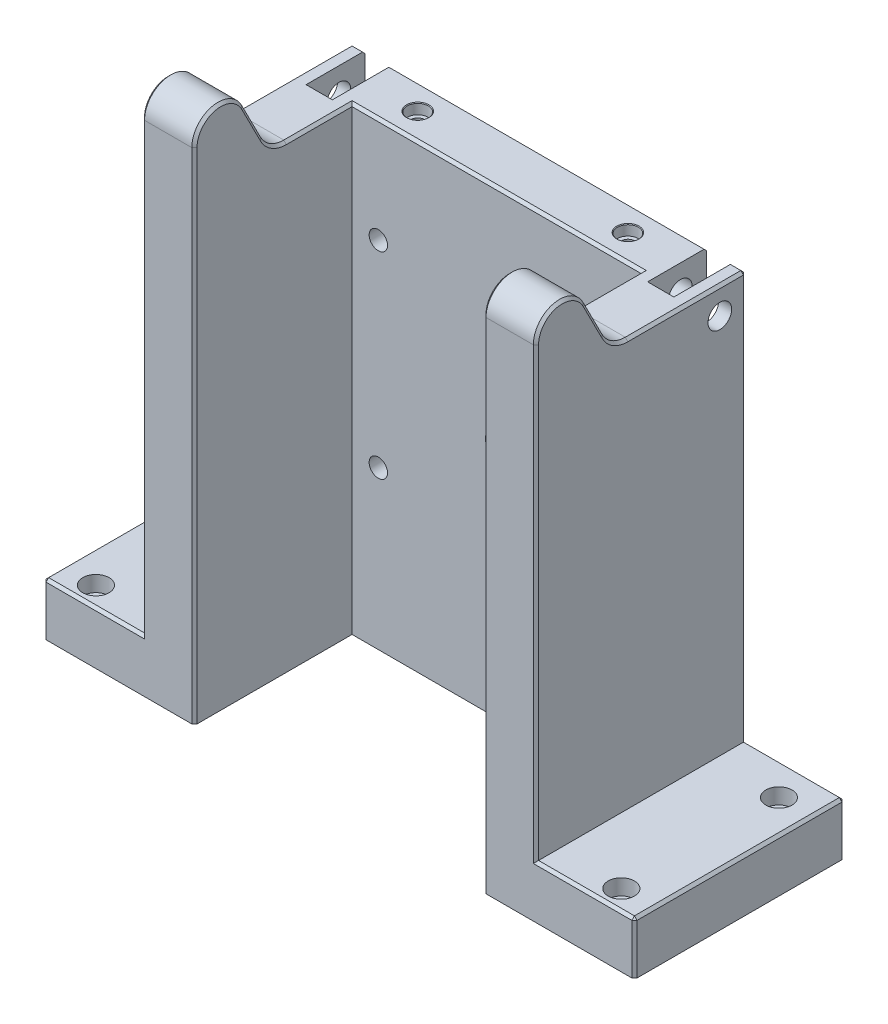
ISO-10303-21;
HEADER;
FILE_DESCRIPTION(('STEP AP214'),'2;1');
FILE_NAME('part.step','',(''),(''),'','','');
FILE_SCHEMA(('AUTOMOTIVE_DESIGN { 1 0 10303 214 1 1 1 1 }'));
ENDSEC;
DATA;
#1=APPLICATION_CONTEXT('core data for automotive mechanical design processes');
#2=APPLICATION_PROTOCOL_DEFINITION('international standard','automotive_design',2000,#1);
#3=PRODUCT_CONTEXT('',#1,'mechanical');
#4=PRODUCT('Part','Part','',(#3));
#5=PRODUCT_RELATED_PRODUCT_CATEGORY('part','',(#4));
#6=PRODUCT_DEFINITION_FORMATION('','',#4);
#7=PRODUCT_DEFINITION_CONTEXT('part definition',#1,'design');
#8=PRODUCT_DEFINITION('design','',#6,#7);
#9=PRODUCT_DEFINITION_SHAPE('','',#8);
#10=(LENGTH_UNIT() NAMED_UNIT(*) SI_UNIT(.MILLI.,.METRE.));
#11=(NAMED_UNIT(*) PLANE_ANGLE_UNIT() SI_UNIT($,.RADIAN.));
#12=(NAMED_UNIT(*) SI_UNIT($,.STERADIAN.) SOLID_ANGLE_UNIT());
#13=UNCERTAINTY_MEASURE_WITH_UNIT(LENGTH_MEASURE(1.E-05),#10,'distance_accuracy_value','');
#14=(GEOMETRIC_REPRESENTATION_CONTEXT(3) GLOBAL_UNCERTAINTY_ASSIGNED_CONTEXT((#13)) GLOBAL_UNIT_ASSIGNED_CONTEXT((#10,
#11,#12)) REPRESENTATION_CONTEXT('',''));
#15=CARTESIAN_POINT('',(0.,0.,0.));
#16=DIRECTION('',(0.,0.,1.));
#17=DIRECTION('',(1.,0.,0.));
#18=AXIS2_PLACEMENT_3D('',#15,#16,#17);
#19=CARTESIAN_POINT('',(-150.,350.,160.));
#20=DIRECTION('',(1.,0.,0.));
#21=DIRECTION('',(0.,1.,0.));
#22=AXIS2_PLACEMENT_3D('',#19,#20,#21);
#23=PLANE('',#22);
#24=DIRECTION('',(0.,0.,-1.));
#25=VECTOR('',#24,1.);
#26=CARTESIAN_POINT('',(-150.,40.,160.));
#27=LINE('',#26,#25);
#28=CARTESIAN_POINT('',(-150.,40.,158.));
#29=VERTEX_POINT('',#28);
#30=CARTESIAN_POINT('',(-150.,40.,2.));
#31=VERTEX_POINT('',#30);
#32=EDGE_CURVE('E587',#29,#31,#27,.T.);
#33=ORIENTED_EDGE('',*,*,#32,.F.);
#34=DIRECTION('',(0.,1.,0.));
#35=VECTOR('',#34,1.);
#36=CARTESIAN_POINT('',(-150.,380.,158.));
#37=LINE('',#36,#35);
#38=CARTESIAN_POINT('',(-150.,380.,158.));
#39=VERTEX_POINT('',#38);
#40=EDGE_CURVE('E751',#29,#39,#37,.T.);
#41=ORIENTED_EDGE('',*,*,#40,.T.);
#42=CARTESIAN_POINT('',(-150.,380.,140.));
#43=DIRECTION('',(1.,0.,0.));
#44=DIRECTION('',(0.,1.,0.));
#45=AXIS2_PLACEMENT_3D('',#42,#43,#44);
#46=CIRCLE('',#45,18.);
#47=CARTESIAN_POINT('',(-150.,388.177114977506,123.964577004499));
#48=VERTEX_POINT('',#47);
#49=EDGE_CURVE('E749',#39,#48,#46,.F.);
#50=ORIENTED_EDGE('',*,*,#49,.T.);
#51=DIRECTION('',(0.,-0.890856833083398,-0.454284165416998));
#52=VECTOR('',#51,1.);
#53=CARTESIAN_POINT('',(-150.,360.005748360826,109.598850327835));
#54=LINE('',#53,#52);
#55=CARTESIAN_POINT('',(-150.,360.005748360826,109.598850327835));
#56=VERTEX_POINT('',#55);
#57=EDGE_CURVE('E747',#48,#56,#54,.T.);
#58=ORIENTED_EDGE('',*,*,#57,.T.);
#59=CARTESIAN_POINT('',(-150.,370.,90.));
#60=DIRECTION('',(1.,0.,0.));
#61=DIRECTION('',(0.,1.,0.));
#62=AXIS2_PLACEMENT_3D('',#59,#60,#61);
#63=CIRCLE('',#62,22.);
#64=CARTESIAN_POINT('',(-150.,348.,90.));
#65=VERTEX_POINT('',#64);
#66=EDGE_CURVE('E745',#56,#65,#63,.T.);
#67=ORIENTED_EDGE('',*,*,#66,.T.);
#68=DIRECTION('',(0.,0.,-1.));
#69=VECTOR('',#68,1.);
#70=CARTESIAN_POINT('',(-150.,348.,160.));
#71=LINE('',#70,#69);
#72=CARTESIAN_POINT('',(-150.,348.,2.));
#73=VERTEX_POINT('',#72);
#74=EDGE_CURVE('E742',#65,#73,#71,.T.);
#75=ORIENTED_EDGE('',*,*,#74,.T.);
#76=DIRECTION('',(0.,-1.,0.));
#77=VECTOR('',#76,1.);
#78=CARTESIAN_POINT('',(-150.,350.,2.));
#79=LINE('',#78,#77);
#80=EDGE_CURVE('E740',#73,#31,#79,.T.);
#81=ORIENTED_EDGE('',*,*,#80,.T.);
#82=EDGE_LOOP('',(#33,#41,#50,#58,#67,#75,#81));
#83=FACE_BOUND('',#82,.T.);
#84=CARTESIAN_POINT('',(-150.,330.,20.));
#85=DIRECTION('',(-1.,0.,0.));
#86=DIRECTION('',(0.,0.,1.));
#87=AXIS2_PLACEMENT_3D('',#84,#85,#86);
#88=CIRCLE('',#87,9.00000000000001);
#89=CARTESIAN_POINT('',(-150.,330.,29.));
#90=VERTEX_POINT('',#89);
#91=EDGE_CURVE('E406',#90,#90,#88,.T.);
#92=ORIENTED_EDGE('',*,*,#91,.F.);
#93=EDGE_LOOP('',(#92));
#94=FACE_BOUND('',#93,.T.);
#95=ADVANCED_FACE('F34',(#83,#94),#23,.F.);
#96=CARTESIAN_POINT('',(150.,350.,160.));
#97=DIRECTION('',(0.,-1.,0.));
#98=DIRECTION('',(0.,0.,-1.));
#99=AXIS2_PLACEMENT_3D('',#96,#97,#98);
#100=PLANE('',#99);
#101=CARTESIAN_POINT('',(-80.,350.,20.));
#102=DIRECTION('',(0.,-1.,0.));
#103=DIRECTION('',(0.,0.,-1.));
#104=AXIS2_PLACEMENT_3D('',#101,#102,#103);
#105=CIRCLE('',#104,8.50000000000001);
#106=CARTESIAN_POINT('',(-80.,350.,11.5));
#107=VERTEX_POINT('',#106);
#108=EDGE_CURVE('E945',#107,#107,#105,.T.);
#109=ORIENTED_EDGE('',*,*,#108,.T.);
#110=EDGE_LOOP('',(#109));
#111=FACE_BOUND('',#110,.T.);
#112=CARTESIAN_POINT('',(80.,350.,20.));
#113=DIRECTION('',(0.,-1.,0.));
#114=DIRECTION('',(0.,0.,-1.));
#115=AXIS2_PLACEMENT_3D('',#112,#113,#114);
#116=CIRCLE('',#115,8.50000000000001);
#117=CARTESIAN_POINT('',(80.,350.,11.5));
#118=VERTEX_POINT('',#117);
#119=EDGE_CURVE('E942',#118,#118,#116,.T.);
#120=ORIENTED_EDGE('',*,*,#119,.T.);
#121=EDGE_LOOP('',(#120));
#122=FACE_BOUND('',#121,.T.);
#123=DIRECTION('',(1.,0.,0.));
#124=VECTOR('',#123,1.);
#125=CARTESIAN_POINT('',(150.,350.,38.));
#126=LINE('',#125,#124);
#127=CARTESIAN_POINT('',(-112.,350.,38.));
#128=VERTEX_POINT('',#127);
#129=CARTESIAN_POINT('',(112.,350.,38.));
#130=VERTEX_POINT('',#129);
#131=EDGE_CURVE('E704',#128,#130,#126,.T.);
#132=ORIENTED_EDGE('',*,*,#131,.T.);
#133=DIRECTION('',(0.,0.,1.));
#134=VECTOR('',#133,1.);
#135=CARTESIAN_POINT('',(112.,350.,160.));
#136=LINE('',#135,#134);
#137=CARTESIAN_POINT('',(112.,350.,90.));
#138=VERTEX_POINT('',#137);
#139=EDGE_CURVE('E706',#130,#138,#136,.T.);
#140=ORIENTED_EDGE('',*,*,#139,.T.);
#141=DIRECTION('',(1.,0.,0.));
#142=VECTOR('',#141,1.);
#143=CARTESIAN_POINT('',(23.9767473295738,350.,90.));
#144=LINE('',#143,#142);
#145=CARTESIAN_POINT('',(148.,350.,90.));
#146=VERTEX_POINT('',#145);
#147=EDGE_CURVE('E474',#138,#146,#144,.T.);
#148=ORIENTED_EDGE('',*,*,#147,.T.);
#149=DIRECTION('',(0.,0.,-1.));
#150=VECTOR('',#149,1.);
#151=CARTESIAN_POINT('',(148.,350.,160.));
#152=LINE('',#151,#150);
#153=CARTESIAN_POINT('',(148.,350.,2.));
#154=VERTEX_POINT('',#153);
#155=EDGE_CURVE('E691',#146,#154,#152,.T.);
#156=ORIENTED_EDGE('',*,*,#155,.T.);
#157=DIRECTION('',(-1.,0.,0.));
#158=VECTOR('',#157,1.);
#159=CARTESIAN_POINT('',(150.,350.,2.));
#160=LINE('',#159,#158);
#161=CARTESIAN_POINT('',(140.,350.,2.));
#162=VERTEX_POINT('',#161);
#163=EDGE_CURVE('E689',#154,#162,#160,.T.);
#164=ORIENTED_EDGE('',*,*,#163,.T.);
#165=DIRECTION('',(0.,0.,-1.));
#166=VECTOR('',#165,1.);
#167=CARTESIAN_POINT('',(140.,350.,0.));
#168=LINE('',#167,#166);
#169=CARTESIAN_POINT('',(140.,350.,45.));
#170=VERTEX_POINT('',#169);
#171=EDGE_CURVE('E434',#170,#162,#168,.T.);
#172=ORIENTED_EDGE('',*,*,#171,.F.);
#173=DIRECTION('',(1.,0.,0.));
#174=VECTOR('',#173,1.);
#175=CARTESIAN_POINT('',(140.,350.,45.));
#176=LINE('',#175,#174);
#177=CARTESIAN_POINT('',(120.,350.,45.));
#178=VERTEX_POINT('',#177);
#179=EDGE_CURVE('E446',#178,#170,#176,.T.);
#180=ORIENTED_EDGE('',*,*,#179,.F.);
#181=DIRECTION('',(0.,0.,1.));
#182=VECTOR('',#181,1.);
#183=CARTESIAN_POINT('',(120.,350.,0.));
#184=LINE('',#183,#182);
#185=CARTESIAN_POINT('',(120.,350.,2.));
#186=VERTEX_POINT('',#185);
#187=EDGE_CURVE('E452',#186,#178,#184,.T.);
#188=ORIENTED_EDGE('',*,*,#187,.F.);
#189=DIRECTION('',(-1.,0.,0.));
#190=VECTOR('',#189,1.);
#191=CARTESIAN_POINT('',(150.,350.,2.));
#192=LINE('',#191,#190);
#193=CARTESIAN_POINT('',(-120.,350.,2.));
#194=VERTEX_POINT('',#193);
#195=EDGE_CURVE('E694',#186,#194,#192,.T.);
#196=ORIENTED_EDGE('',*,*,#195,.T.);
#197=DIRECTION('',(0.,0.,-1.));
#198=VECTOR('',#197,1.);
#199=CARTESIAN_POINT('',(-120.,350.,0.));
#200=LINE('',#199,#198);
#201=CARTESIAN_POINT('',(-120.,350.,45.));
#202=VERTEX_POINT('',#201);
#203=EDGE_CURVE('E421',#202,#194,#200,.T.);
#204=ORIENTED_EDGE('',*,*,#203,.F.);
#205=DIRECTION('',(1.,0.,0.));
#206=VECTOR('',#205,1.);
#207=CARTESIAN_POINT('',(-140.,350.,45.));
#208=LINE('',#207,#206);
#209=CARTESIAN_POINT('',(-140.,350.,45.));
#210=VERTEX_POINT('',#209);
#211=EDGE_CURVE('E426',#210,#202,#208,.T.);
#212=ORIENTED_EDGE('',*,*,#211,.F.);
#213=DIRECTION('',(0.,0.,1.));
#214=VECTOR('',#213,1.);
#215=CARTESIAN_POINT('',(-140.,350.,0.));
#216=LINE('',#215,#214);
#217=CARTESIAN_POINT('',(-140.,350.,2.));
#218=VERTEX_POINT('',#217);
#219=EDGE_CURVE('E416',#218,#210,#216,.T.);
#220=ORIENTED_EDGE('',*,*,#219,.F.);
#221=DIRECTION('',(-1.,0.,0.));
#222=VECTOR('',#221,1.);
#223=CARTESIAN_POINT('',(150.,350.,2.));
#224=LINE('',#223,#222);
#225=CARTESIAN_POINT('',(-148.,350.,2.));
#226=VERTEX_POINT('',#225);
#227=EDGE_CURVE('E697',#218,#226,#224,.T.);
#228=ORIENTED_EDGE('',*,*,#227,.T.);
#229=DIRECTION('',(0.,0.,1.));
#230=VECTOR('',#229,1.);
#231=CARTESIAN_POINT('',(-148.,350.,160.));
#232=LINE('',#231,#230);
#233=CARTESIAN_POINT('',(-148.,350.,90.));
#234=VERTEX_POINT('',#233);
#235=EDGE_CURVE('E699',#226,#234,#232,.T.);
#236=ORIENTED_EDGE('',*,*,#235,.T.);
#237=DIRECTION('',(-1.,0.,0.));
#238=VECTOR('',#237,1.);
#239=CARTESIAN_POINT('',(-23.9767473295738,350.,90.));
#240=LINE('',#239,#238);
#241=CARTESIAN_POINT('',(-112.,350.,90.));
#242=VERTEX_POINT('',#241);
#243=EDGE_CURVE('E479',#242,#234,#240,.T.);
#244=ORIENTED_EDGE('',*,*,#243,.F.);
#245=DIRECTION('',(0.,0.,-1.));
#246=VECTOR('',#245,1.);
#247=CARTESIAN_POINT('',(-112.,350.,160.));
#248=LINE('',#247,#246);
#249=EDGE_CURVE('E702',#242,#128,#248,.T.);
#250=ORIENTED_EDGE('',*,*,#249,.T.);
#251=EDGE_LOOP('',(#132,#140,#148,#156,#164,#172,#180,#188,#196,#204,#212,#220,#228,#236,#244,#250));
#252=FACE_BOUND('',#251,.T.);
#253=ADVANCED_FACE('F972',(#111,#122,#252),#100,.F.);
#254=CARTESIAN_POINT('',(-225.,0.,160.));
#255=DIRECTION('',(0.,0.,1.));
#256=DIRECTION('',(1.,0.,0.));
#257=AXIS2_PLACEMENT_3D('',#254,#255,#256);
#258=PLANE('',#257);
#259=DIRECTION('',(1.,0.,0.));
#260=VECTOR('',#259,1.);
#261=CARTESIAN_POINT('',(-225.,0.,160.));
#262=LINE('',#261,#260);
#263=CARTESIAN_POINT('',(-223.,0.,160.));
#264=VERTEX_POINT('',#263);
#265=CARTESIAN_POINT('',(-112.,0.,160.));
#266=VERTEX_POINT('',#265);
#267=EDGE_CURVE('E584',#264,#266,#262,.T.);
#268=ORIENTED_EDGE('',*,*,#267,.T.);
#269=DIRECTION('',(0.,1.,0.));
#270=VECTOR('',#269,1.);
#271=CARTESIAN_POINT('',(-112.,380.,160.));
#272=LINE('',#271,#270);
#273=CARTESIAN_POINT('',(-112.,380.,160.));
#274=VERTEX_POINT('',#273);
#275=EDGE_CURVE('E738',#266,#274,#272,.T.);
#276=ORIENTED_EDGE('',*,*,#275,.T.);
#277=DIRECTION('',(-1.,0.,0.));
#278=VECTOR('',#277,1.);
#279=CARTESIAN_POINT('',(-23.9767473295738,380.,160.));
#280=LINE('',#279,#278);
#281=CARTESIAN_POINT('',(-148.,380.,160.));
#282=VERTEX_POINT('',#281);
#283=EDGE_CURVE('E470',#274,#282,#280,.T.);
#284=ORIENTED_EDGE('',*,*,#283,.T.);
#285=DIRECTION('',(0.,-1.,0.));
#286=VECTOR('',#285,1.);
#287=CARTESIAN_POINT('',(-148.,40.,160.));
#288=LINE('',#287,#286);
#289=CARTESIAN_POINT('',(-148.,38.,160.));
#290=VERTEX_POINT('',#289);
#291=EDGE_CURVE('E736',#282,#290,#288,.T.);
#292=ORIENTED_EDGE('',*,*,#291,.T.);
#293=DIRECTION('',(-1.,0.,0.));
#294=VECTOR('',#293,1.);
#295=CARTESIAN_POINT('',(-225.,38.,160.));
#296=LINE('',#295,#294);
#297=CARTESIAN_POINT('',(-223.,38.,160.));
#298=VERTEX_POINT('',#297);
#299=EDGE_CURVE('E734',#290,#298,#296,.T.);
#300=ORIENTED_EDGE('',*,*,#299,.T.);
#301=DIRECTION('',(0.,-1.,0.));
#302=VECTOR('',#301,1.);
#303=CARTESIAN_POINT('',(-223.,0.,160.));
#304=LINE('',#303,#302);
#305=EDGE_CURVE('E732',#298,#264,#304,.T.);
#306=ORIENTED_EDGE('',*,*,#305,.T.);
#307=EDGE_LOOP('',(#268,#276,#284,#292,#300,#306));
#308=FACE_BOUND('',#307,.T.);
#309=ADVANCED_FACE('F978',(#308),#258,.T.);
#310=CARTESIAN_POINT('',(-225.,40.,160.));
#311=DIRECTION('',(1.,0.,0.));
#312=DIRECTION('',(0.,0.,-1.));
#313=AXIS2_PLACEMENT_3D('',#310,#311,#312);
#314=PLANE('',#313);
#315=DIRECTION('',(0.,0.,-1.));
#316=VECTOR('',#315,1.);
#317=CARTESIAN_POINT('',(-225.,0.,160.));
#318=LINE('',#317,#316);
#319=CARTESIAN_POINT('',(-225.,0.,158.));
#320=VERTEX_POINT('',#319);
#321=CARTESIAN_POINT('',(-225.,0.,2.00000000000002));
#322=VERTEX_POINT('',#321);
#323=EDGE_CURVE('E599',#320,#322,#318,.T.);
#324=ORIENTED_EDGE('',*,*,#323,.F.);
#325=DIRECTION('',(0.,1.,0.));
#326=VECTOR('',#325,1.);
#327=CARTESIAN_POINT('',(-225.,40.,158.));
#328=LINE('',#327,#326);
#329=CARTESIAN_POINT('',(-225.,38.,158.));
#330=VERTEX_POINT('',#329);
#331=EDGE_CURVE('E763',#320,#330,#328,.T.);
#332=ORIENTED_EDGE('',*,*,#331,.T.);
#333=DIRECTION('',(0.,0.,-1.));
#334=VECTOR('',#333,1.);
#335=CARTESIAN_POINT('',(-225.,38.,160.));
#336=LINE('',#335,#334);
#337=CARTESIAN_POINT('',(-225.,38.,2.));
#338=VERTEX_POINT('',#337);
#339=EDGE_CURVE('E761',#330,#338,#336,.T.);
#340=ORIENTED_EDGE('',*,*,#339,.T.);
#341=DIRECTION('',(0.,-1.,0.));
#342=VECTOR('',#341,1.);
#343=CARTESIAN_POINT('',(-225.,40.,2.));
#344=LINE('',#343,#342);
#345=EDGE_CURVE('E759',#338,#322,#344,.T.);
#346=ORIENTED_EDGE('',*,*,#345,.T.);
#347=EDGE_LOOP('',(#324,#332,#340,#346));
#348=FACE_BOUND('',#347,.T.);
#349=ADVANCED_FACE('F1001',(#348),#314,.F.);
#350=CARTESIAN_POINT('',(-225.,0.,160.));
#351=DIRECTION('',(0.,1.,0.));
#352=DIRECTION('',(0.,0.,1.));
#353=AXIS2_PLACEMENT_3D('',#350,#351,#352);
#354=PLANE('',#353);
#355=CARTESIAN_POINT('',(160.,0.,65.));
#356=DIRECTION('',(0.,1.,0.));
#357=DIRECTION('',(0.,0.,1.));
#358=AXIS2_PLACEMENT_3D('',#355,#356,#357);
#359=CIRCLE('',#358,10.0000000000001);
#360=CARTESIAN_POINT('',(160.,0.,75.0000000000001));
#361=VERTEX_POINT('',#360);
#362=EDGE_CURVE('E42',#361,#361,#359,.T.);
#363=ORIENTED_EDGE('',*,*,#362,.T.);
#364=EDGE_LOOP('',(#363));
#365=FACE_BOUND('',#364,.T.);
#366=CARTESIAN_POINT('',(-160.,0.,65.));
#367=DIRECTION('',(0.,1.,0.));
#368=DIRECTION('',(0.,0.,1.));
#369=AXIS2_PLACEMENT_3D('',#366,#367,#368);
#370=CIRCLE('',#369,10.0000000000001);
#371=CARTESIAN_POINT('',(-160.,0.,75.0000000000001));
#372=VERTEX_POINT('',#371);
#373=EDGE_CURVE('E954',#372,#372,#370,.T.);
#374=ORIENTED_EDGE('',*,*,#373,.T.);
#375=EDGE_LOOP('',(#374));
#376=FACE_BOUND('',#375,.T.);
#377=CARTESIAN_POINT('',(-200.,0.,25.));
#378=DIRECTION('',(0.,1.,0.));
#379=DIRECTION('',(0.,0.,1.));
#380=AXIS2_PLACEMENT_3D('',#377,#378,#379);
#381=CIRCLE('',#380,6.74999999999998);
#382=CARTESIAN_POINT('',(-200.,0.,31.75));
#383=VERTEX_POINT('',#382);
#384=EDGE_CURVE('E544',#383,#383,#381,.T.);
#385=ORIENTED_EDGE('',*,*,#384,.T.);
#386=EDGE_LOOP('',(#385));
#387=FACE_BOUND('',#386,.T.);
#388=CARTESIAN_POINT('',(200.,0.,25.));
#389=DIRECTION('',(0.,1.,0.));
#390=DIRECTION('',(0.,0.,1.));
#391=AXIS2_PLACEMENT_3D('',#388,#389,#390);
#392=CIRCLE('',#391,6.74999999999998);
#393=CARTESIAN_POINT('',(200.,0.,31.75));
#394=VERTEX_POINT('',#393);
#395=EDGE_CURVE('E556',#394,#394,#392,.T.);
#396=ORIENTED_EDGE('',*,*,#395,.T.);
#397=EDGE_LOOP('',(#396));
#398=FACE_BOUND('',#397,.T.);
#399=CARTESIAN_POINT('',(-200.,0.,145.));
#400=DIRECTION('',(0.,1.,0.));
#401=DIRECTION('',(0.,0.,1.));
#402=AXIS2_PLACEMENT_3D('',#399,#400,#401);
#403=CIRCLE('',#402,6.74999999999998);
#404=CARTESIAN_POINT('',(-200.,0.,151.75));
#405=VERTEX_POINT('',#404);
#406=EDGE_CURVE('E568',#405,#405,#403,.T.);
#407=ORIENTED_EDGE('',*,*,#406,.T.);
#408=EDGE_LOOP('',(#407));
#409=FACE_BOUND('',#408,.T.);
#410=CARTESIAN_POINT('',(200.,0.,145.));
#411=DIRECTION('',(0.,1.,0.));
#412=DIRECTION('',(0.,0.,1.));
#413=AXIS2_PLACEMENT_3D('',#410,#411,#412);
#414=CIRCLE('',#413,6.74999999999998);
#415=CARTESIAN_POINT('',(200.,0.,151.75));
#416=VERTEX_POINT('',#415);
#417=EDGE_CURVE('E580',#416,#416,#414,.T.);
#418=ORIENTED_EDGE('',*,*,#417,.T.);
#419=EDGE_LOOP('',(#418));
#420=FACE_BOUND('',#419,.T.);
#421=CARTESIAN_POINT('',(112.,0.,160.));
#422=VERTEX_POINT('',#421);
#423=CARTESIAN_POINT('',(223.,0.,160.));
#424=VERTEX_POINT('',#423);
#425=EDGE_CURVE('E588',#422,#424,#262,.T.);
#426=ORIENTED_EDGE('',*,*,#425,.F.);
#427=DIRECTION('',(-0.70710678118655,0.,-0.707106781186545));
#428=VECTOR('',#427,1.);
#429=CARTESIAN_POINT('',(112.,0.,160.));
#430=LINE('',#429,#428);
#431=CARTESIAN_POINT('',(110.,0.,158.));
#432=VERTEX_POINT('',#431);
#433=EDGE_CURVE('E665',#422,#432,#430,.T.);
#434=ORIENTED_EDGE('',*,*,#433,.T.);
#435=DIRECTION('',(0.,0.,1.));
#436=VECTOR('',#435,1.);
#437=CARTESIAN_POINT('',(110.,0.,160.));
#438=LINE('',#437,#436);
#439=CARTESIAN_POINT('',(110.,0.,40.));
#440=VERTEX_POINT('',#439);
#441=EDGE_CURVE('E510',#440,#432,#438,.T.);
#442=ORIENTED_EDGE('',*,*,#441,.F.);
#443=DIRECTION('',(1.,0.,0.));
#444=VECTOR('',#443,1.);
#445=CARTESIAN_POINT('',(-110.,0.,40.));
#446=LINE('',#445,#444);
#447=CARTESIAN_POINT('',(-110.,0.,40.));
#448=VERTEX_POINT('',#447);
#449=EDGE_CURVE('E507',#448,#440,#446,.T.);
#450=ORIENTED_EDGE('',*,*,#449,.F.);
#451=DIRECTION('',(0.,0.,-1.));
#452=VECTOR('',#451,1.);
#453=CARTESIAN_POINT('',(-110.,0.,160.));
#454=LINE('',#453,#452);
#455=CARTESIAN_POINT('',(-110.,0.,158.));
#456=VERTEX_POINT('',#455);
#457=EDGE_CURVE('E504',#456,#448,#454,.T.);
#458=ORIENTED_EDGE('',*,*,#457,.F.);
#459=DIRECTION('',(-0.707106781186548,0.,0.707106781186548));
#460=VECTOR('',#459,1.);
#461=CARTESIAN_POINT('',(-110.,0.,158.));
#462=LINE('',#461,#460);
#463=EDGE_CURVE('E663',#456,#266,#462,.T.);
#464=ORIENTED_EDGE('',*,*,#463,.T.);
#465=ORIENTED_EDGE('',*,*,#267,.F.);
#466=DIRECTION('',(-0.707106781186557,0.,-0.707106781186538));
#467=VECTOR('',#466,1.);
#468=CARTESIAN_POINT('',(-223.,0.,160.));
#469=LINE('',#468,#467);
#470=EDGE_CURVE('E661',#264,#320,#469,.T.);
#471=ORIENTED_EDGE('',*,*,#470,.T.);
#472=ORIENTED_EDGE('',*,*,#323,.T.);
#473=DIRECTION('',(-0.707106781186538,0.,0.707106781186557));
#474=VECTOR('',#473,1.);
#475=CARTESIAN_POINT('',(-225.,0.,2.));
#476=LINE('',#475,#474);
#477=CARTESIAN_POINT('',(-223.,0.,0.));
#478=VERTEX_POINT('',#477);
#479=EDGE_CURVE('E659',#322,#478,#476,.F.);
#480=ORIENTED_EDGE('',*,*,#479,.T.);
#481=DIRECTION('',(1.,0.,0.));
#482=VECTOR('',#481,1.);
#483=CARTESIAN_POINT('',(-225.,0.,0.));
#484=LINE('',#483,#482);
#485=CARTESIAN_POINT('',(223.,0.,0.));
#486=VERTEX_POINT('',#485);
#487=EDGE_CURVE('E583',#478,#486,#484,.T.);
#488=ORIENTED_EDGE('',*,*,#487,.T.);
#489=DIRECTION('',(-0.707106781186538,0.,-0.707106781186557));
#490=VECTOR('',#489,1.);
#491=CARTESIAN_POINT('',(225.,0.,2.));
#492=LINE('',#491,#490);
#493=CARTESIAN_POINT('',(225.,0.,2.00000000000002));
#494=VERTEX_POINT('',#493);
#495=EDGE_CURVE('E655',#486,#494,#492,.F.);
#496=ORIENTED_EDGE('',*,*,#495,.T.);
#497=DIRECTION('',(0.,0.,-1.));
#498=VECTOR('',#497,1.);
#499=CARTESIAN_POINT('',(225.,0.,160.));
#500=LINE('',#499,#498);
#501=CARTESIAN_POINT('',(225.,0.,158.));
#502=VERTEX_POINT('',#501);
#503=EDGE_CURVE('E596',#502,#494,#500,.T.);
#504=ORIENTED_EDGE('',*,*,#503,.F.);
#505=DIRECTION('',(-0.707106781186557,0.,0.707106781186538));
#506=VECTOR('',#505,1.);
#507=CARTESIAN_POINT('',(223.,0.,160.));
#508=LINE('',#507,#506);
#509=EDGE_CURVE('E657',#502,#424,#508,.T.);
#510=ORIENTED_EDGE('',*,*,#509,.T.);
#511=EDGE_LOOP('',(#426,#434,#442,#450,#458,#464,#465,#471,#472,#480,#488,#496,#504,#510));
#512=FACE_BOUND('',#511,.T.);
#513=ADVANCED_FACE('F959',(#365,#376,#387,#398,#409,#420,#512),#354,.F.);
#514=CARTESIAN_POINT('',(225.,0.,160.));
#515=DIRECTION('',(-1.,0.,0.));
#516=DIRECTION('',(0.,0.,1.));
#517=AXIS2_PLACEMENT_3D('',#514,#515,#516);
#518=PLANE('',#517);
#519=DIRECTION('',(0.,0.,1.));
#520=VECTOR('',#519,1.);
#521=CARTESIAN_POINT('',(225.,38.0000000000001,160.));
#522=LINE('',#521,#520);
#523=CARTESIAN_POINT('',(225.,38.0000000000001,2.));
#524=VERTEX_POINT('',#523);
#525=CARTESIAN_POINT('',(225.,38.0000000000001,158.));
#526=VERTEX_POINT('',#525);
#527=EDGE_CURVE('E804',#524,#526,#522,.T.);
#528=ORIENTED_EDGE('',*,*,#527,.T.);
#529=DIRECTION('',(0.,-1.,0.));
#530=VECTOR('',#529,1.);
#531=CARTESIAN_POINT('',(225.,0.,158.));
#532=LINE('',#531,#530);
#533=EDGE_CURVE('E806',#526,#502,#532,.T.);
#534=ORIENTED_EDGE('',*,*,#533,.T.);
#535=ORIENTED_EDGE('',*,*,#503,.T.);
#536=DIRECTION('',(0.,1.,0.));
#537=VECTOR('',#536,1.);
#538=CARTESIAN_POINT('',(225.,0.,2.));
#539=LINE('',#538,#537);
#540=EDGE_CURVE('E802',#494,#524,#539,.T.);
#541=ORIENTED_EDGE('',*,*,#540,.T.);
#542=EDGE_LOOP('',(#528,#534,#535,#541));
#543=FACE_BOUND('',#542,.T.);
#544=ADVANCED_FACE('F994',(#543),#518,.F.);
#545=CARTESIAN_POINT('',(225.,40.,160.));
#546=DIRECTION('',(0.,-1.,0.));
#547=DIRECTION('',(1.,0.,0.));
#548=AXIS2_PLACEMENT_3D('',#545,#546,#547);
#549=PLANE('',#548);
#550=CARTESIAN_POINT('',(200.,40.0000000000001,25.));
#551=DIRECTION('',(0.,1.,0.));
#552=DIRECTION('',(0.,0.,1.));
#553=AXIS2_PLACEMENT_3D('',#550,#551,#552);
#554=CIRCLE('',#553,10.);
#555=CARTESIAN_POINT('',(200.,40.0000000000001,35.));
#556=VERTEX_POINT('',#555);
#557=EDGE_CURVE('E547',#556,#556,#554,.T.);
#558=ORIENTED_EDGE('',*,*,#557,.F.);
#559=EDGE_LOOP('',(#558));
#560=FACE_BOUND('',#559,.T.);
#561=CARTESIAN_POINT('',(200.,40.0000000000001,145.));
#562=DIRECTION('',(0.,1.,0.));
#563=DIRECTION('',(0.,0.,1.));
#564=AXIS2_PLACEMENT_3D('',#561,#562,#563);
#565=CIRCLE('',#564,10.);
#566=CARTESIAN_POINT('',(200.,40.0000000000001,155.));
#567=VERTEX_POINT('',#566);
#568=EDGE_CURVE('E571',#567,#567,#565,.T.);
#569=ORIENTED_EDGE('',*,*,#568,.F.);
#570=EDGE_LOOP('',(#569));
#571=FACE_BOUND('',#570,.T.);
#572=DIRECTION('',(0.,0.,-1.));
#573=VECTOR('',#572,1.);
#574=CARTESIAN_POINT('',(150.,40.,160.));
#575=LINE('',#574,#573);
#576=CARTESIAN_POINT('',(150.,40.,158.));
#577=VERTEX_POINT('',#576);
#578=CARTESIAN_POINT('',(150.,40.,2.));
#579=VERTEX_POINT('',#578);
#580=EDGE_CURVE('E593',#577,#579,#575,.T.);
#581=ORIENTED_EDGE('',*,*,#580,.F.);
#582=DIRECTION('',(1.,0.,0.));
#583=VECTOR('',#582,1.);
#584=CARTESIAN_POINT('',(225.,40.,158.));
#585=LINE('',#584,#583);
#586=CARTESIAN_POINT('',(223.,40.,158.));
#587=VERTEX_POINT('',#586);
#588=EDGE_CURVE('E49',#577,#587,#585,.T.);
#589=ORIENTED_EDGE('',*,*,#588,.T.);
#590=DIRECTION('',(0.,0.,-1.));
#591=VECTOR('',#590,1.);
#592=CARTESIAN_POINT('',(223.,40.,160.));
#593=LINE('',#592,#591);
#594=CARTESIAN_POINT('',(223.,40.,2.));
#595=VERTEX_POINT('',#594);
#596=EDGE_CURVE('E54',#587,#595,#593,.T.);
#597=ORIENTED_EDGE('',*,*,#596,.T.);
#598=DIRECTION('',(-1.,0.,0.));
#599=VECTOR('',#598,1.);
#600=CARTESIAN_POINT('',(225.,40.,2.));
#601=LINE('',#600,#599);
#602=EDGE_CURVE('E808',#595,#579,#601,.T.);
#603=ORIENTED_EDGE('',*,*,#602,.T.);
#604=EDGE_LOOP('',(#581,#589,#597,#603));
#605=FACE_BOUND('',#604,.T.);
#606=ADVANCED_FACE('F990',(#560,#571,#605),#549,.F.);
#607=CARTESIAN_POINT('',(150.,40.,160.));
#608=DIRECTION('',(-1.,0.,0.));
#609=DIRECTION('',(0.,-1.,0.));
#610=AXIS2_PLACEMENT_3D('',#607,#608,#609);
#611=PLANE('',#610);
#612=CARTESIAN_POINT('',(150.,330.,20.));
#613=DIRECTION('',(1.,0.,0.));
#614=DIRECTION('',(0.,0.,-1.));
#615=AXIS2_PLACEMENT_3D('',#612,#613,#614);
#616=CIRCLE('',#615,9.00000000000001);
#617=CARTESIAN_POINT('',(150.,330.,11.));
#618=VERTEX_POINT('',#617);
#619=EDGE_CURVE('E395',#618,#618,#616,.T.);
#620=ORIENTED_EDGE('',*,*,#619,.F.);
#621=EDGE_LOOP('',(#620));
#622=FACE_BOUND('',#621,.T.);
#623=CARTESIAN_POINT('',(150.,380.,140.));
#624=DIRECTION('',(-1.,0.,0.));
#625=DIRECTION('',(0.,-1.,0.));
#626=AXIS2_PLACEMENT_3D('',#623,#624,#625);
#627=CIRCLE('',#626,18.);
#628=CARTESIAN_POINT('',(150.,388.177114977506,123.964577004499));
#629=VERTEX_POINT('',#628);
#630=CARTESIAN_POINT('',(150.,380.,158.));
#631=VERTEX_POINT('',#630);
#632=EDGE_CURVE('E798',#629,#631,#627,.F.);
#633=ORIENTED_EDGE('',*,*,#632,.T.);
#634=DIRECTION('',(0.,-1.,0.));
#635=VECTOR('',#634,1.);
#636=CARTESIAN_POINT('',(150.,40.,158.));
#637=LINE('',#636,#635);
#638=EDGE_CURVE('E800',#631,#577,#637,.T.);
#639=ORIENTED_EDGE('',*,*,#638,.T.);
#640=ORIENTED_EDGE('',*,*,#580,.T.);
#641=DIRECTION('',(0.,1.,0.));
#642=VECTOR('',#641,1.);
#643=CARTESIAN_POINT('',(150.,40.,2.));
#644=LINE('',#643,#642);
#645=CARTESIAN_POINT('',(150.,348.,2.));
#646=VERTEX_POINT('',#645);
#647=EDGE_CURVE('E789',#579,#646,#644,.T.);
#648=ORIENTED_EDGE('',*,*,#647,.T.);
#649=DIRECTION('',(0.,0.,1.));
#650=VECTOR('',#649,1.);
#651=CARTESIAN_POINT('',(150.,348.,160.));
#652=LINE('',#651,#650);
#653=CARTESIAN_POINT('',(150.,348.,90.));
#654=VERTEX_POINT('',#653);
#655=EDGE_CURVE('E791',#646,#654,#652,.T.);
#656=ORIENTED_EDGE('',*,*,#655,.T.);
#657=CARTESIAN_POINT('',(150.,370.,90.));
#658=DIRECTION('',(-1.,0.,0.));
#659=DIRECTION('',(0.,-1.,0.));
#660=AXIS2_PLACEMENT_3D('',#657,#658,#659);
#661=CIRCLE('',#660,22.);
#662=CARTESIAN_POINT('',(150.,360.005748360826,109.598850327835));
#663=VERTEX_POINT('',#662);
#664=EDGE_CURVE('E794',#654,#663,#661,.T.);
#665=ORIENTED_EDGE('',*,*,#664,.T.);
#666=DIRECTION('',(0.,0.890856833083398,0.454284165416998));
#667=VECTOR('',#666,1.);
#668=CARTESIAN_POINT('',(150.,388.177114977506,123.964577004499));
#669=LINE('',#668,#667);
#670=EDGE_CURVE('E796',#663,#629,#669,.T.);
#671=ORIENTED_EDGE('',*,*,#670,.T.);
#672=EDGE_LOOP('',(#633,#639,#640,#648,#656,#665,#671));
#673=FACE_BOUND('',#672,.T.);
#674=ADVANCED_FACE('F987',(#622,#673),#611,.F.);
#675=CARTESIAN_POINT('',(-150.,40.,160.));
#676=DIRECTION('',(0.,-1.,0.));
#677=DIRECTION('',(1.,0.,0.));
#678=AXIS2_PLACEMENT_3D('',#675,#676,#677);
#679=PLANE('',#678);
#680=CARTESIAN_POINT('',(-200.,40.,25.));
#681=DIRECTION('',(0.,1.,0.));
#682=DIRECTION('',(0.,0.,1.));
#683=AXIS2_PLACEMENT_3D('',#680,#681,#682);
#684=CIRCLE('',#683,10.);
#685=CARTESIAN_POINT('',(-200.,40.,35.));
#686=VERTEX_POINT('',#685);
#687=EDGE_CURVE('E535',#686,#686,#684,.T.);
#688=ORIENTED_EDGE('',*,*,#687,.F.);
#689=EDGE_LOOP('',(#688));
#690=FACE_BOUND('',#689,.T.);
#691=CARTESIAN_POINT('',(-200.,40.,145.));
#692=DIRECTION('',(0.,1.,0.));
#693=DIRECTION('',(0.,0.,1.));
#694=AXIS2_PLACEMENT_3D('',#691,#692,#693);
#695=CIRCLE('',#694,10.);
#696=CARTESIAN_POINT('',(-200.,40.,155.));
#697=VERTEX_POINT('',#696);
#698=EDGE_CURVE('E559',#697,#697,#695,.T.);
#699=ORIENTED_EDGE('',*,*,#698,.F.);
#700=EDGE_LOOP('',(#699));
#701=FACE_BOUND('',#700,.T.);
#702=DIRECTION('',(0.,0.,1.));
#703=VECTOR('',#702,1.);
#704=CARTESIAN_POINT('',(-223.,40.,160.));
#705=LINE('',#704,#703);
#706=CARTESIAN_POINT('',(-223.,40.,2.));
#707=VERTEX_POINT('',#706);
#708=CARTESIAN_POINT('',(-223.,40.,158.));
#709=VERTEX_POINT('',#708);
#710=EDGE_CURVE('E755',#707,#709,#705,.T.);
#711=ORIENTED_EDGE('',*,*,#710,.T.);
#712=DIRECTION('',(1.,0.,0.));
#713=VECTOR('',#712,1.);
#714=CARTESIAN_POINT('',(-150.,40.,158.));
#715=LINE('',#714,#713);
#716=EDGE_CURVE('E757',#709,#29,#715,.T.);
#717=ORIENTED_EDGE('',*,*,#716,.T.);
#718=ORIENTED_EDGE('',*,*,#32,.T.);
#719=DIRECTION('',(-1.,0.,0.));
#720=VECTOR('',#719,1.);
#721=CARTESIAN_POINT('',(-150.,40.,2.));
#722=LINE('',#721,#720);
#723=EDGE_CURVE('E753',#31,#707,#722,.T.);
#724=ORIENTED_EDGE('',*,*,#723,.T.);
#725=EDGE_LOOP('',(#711,#717,#718,#724));
#726=FACE_BOUND('',#725,.T.);
#727=ADVANCED_FACE('F984',(#690,#701,#726),#679,.F.);
#728=DIRECTION('',(1.,0.,0.));
#729=VECTOR('',#728,1.);
#730=CARTESIAN_POINT('',(23.9767473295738,380.,160.));
#731=LINE('',#730,#729);
#732=CARTESIAN_POINT('',(112.,380.,160.));
#733=VERTEX_POINT('',#732);
#734=CARTESIAN_POINT('',(148.,380.,160.));
#735=VERTEX_POINT('',#734);
#736=EDGE_CURVE('E458',#733,#735,#731,.T.);
#737=ORIENTED_EDGE('',*,*,#736,.F.);
#738=DIRECTION('',(0.,-1.,0.));
#739=VECTOR('',#738,1.);
#740=CARTESIAN_POINT('',(112.,0.,160.));
#741=LINE('',#740,#739);
#742=EDGE_CURVE('E652',#733,#422,#741,.T.);
#743=ORIENTED_EDGE('',*,*,#742,.T.);
#744=ORIENTED_EDGE('',*,*,#425,.T.);
#745=DIRECTION('',(0.,1.,0.));
#746=VECTOR('',#745,1.);
#747=CARTESIAN_POINT('',(223.,40.,160.));
#748=LINE('',#747,#746);
#749=CARTESIAN_POINT('',(223.,38.,160.));
#750=VERTEX_POINT('',#749);
#751=EDGE_CURVE('E648',#424,#750,#748,.T.);
#752=ORIENTED_EDGE('',*,*,#751,.T.);
#753=DIRECTION('',(-1.,0.,0.));
#754=VECTOR('',#753,1.);
#755=CARTESIAN_POINT('',(150.,38.,160.));
#756=LINE('',#755,#754);
#757=CARTESIAN_POINT('',(148.,38.,160.));
#758=VERTEX_POINT('',#757);
#759=EDGE_CURVE('E642',#750,#758,#756,.T.);
#760=ORIENTED_EDGE('',*,*,#759,.T.);
#761=DIRECTION('',(0.,1.,0.));
#762=VECTOR('',#761,1.);
#763=CARTESIAN_POINT('',(148.,380.,160.));
#764=LINE('',#763,#762);
#765=EDGE_CURVE('E650',#758,#735,#764,.T.);
#766=ORIENTED_EDGE('',*,*,#765,.T.);
#767=EDGE_LOOP('',(#737,#743,#744,#752,#760,#766));
#768=FACE_BOUND('',#767,.T.);
#769=ADVANCED_FACE('F1335',(#768),#258,.T.);
#770=CARTESIAN_POINT('',(-225.,0.,0.));
#771=DIRECTION('',(0.,0.,1.));
#772=DIRECTION('',(1.,0.,0.));
#773=AXIS2_PLACEMENT_3D('',#770,#771,#772);
#774=PLANE('',#773);
#775=CARTESIAN_POINT('',(0.,180.,0.));
#776=DIRECTION('',(0.,0.,1.));
#777=DIRECTION('',(1.,0.,0.));
#778=AXIS2_PLACEMENT_3D('',#775,#776,#777);
#779=CIRCLE('',#778,8.4999999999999);
#780=CARTESIAN_POINT('',(8.4999999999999,180.,0.));
#781=VERTEX_POINT('',#780);
#782=EDGE_CURVE('E814',#781,#781,#779,.T.);
#783=ORIENTED_EDGE('',*,*,#782,.T.);
#784=EDGE_LOOP('',(#783));
#785=FACE_BOUND('',#784,.T.);
#786=ORIENTED_EDGE('',*,*,#487,.F.);
#787=DIRECTION('',(0.,1.,0.));
#788=VECTOR('',#787,1.);
#789=CARTESIAN_POINT('',(-223.,0.,0.));
#790=LINE('',#789,#788);
#791=CARTESIAN_POINT('',(-223.,38.0000000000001,0.));
#792=VERTEX_POINT('',#791);
#793=EDGE_CURVE('E781',#478,#792,#790,.T.);
#794=ORIENTED_EDGE('',*,*,#793,.T.);
#795=DIRECTION('',(1.,0.,0.));
#796=VECTOR('',#795,1.);
#797=CARTESIAN_POINT('',(-225.,38.0000000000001,0.));
#798=LINE('',#797,#796);
#799=CARTESIAN_POINT('',(-148.,38.0000000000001,0.));
#800=VERTEX_POINT('',#799);
#801=EDGE_CURVE('E779',#792,#800,#798,.T.);
#802=ORIENTED_EDGE('',*,*,#801,.T.);
#803=DIRECTION('',(0.,1.,0.));
#804=VECTOR('',#803,1.);
#805=CARTESIAN_POINT('',(-148.,0.,0.));
#806=LINE('',#805,#804);
#807=CARTESIAN_POINT('',(-148.,348.,0.));
#808=VERTEX_POINT('',#807);
#809=EDGE_CURVE('E777',#800,#808,#806,.T.);
#810=ORIENTED_EDGE('',*,*,#809,.T.);
#811=DIRECTION('',(1.,0.,0.));
#812=VECTOR('',#811,1.);
#813=CARTESIAN_POINT('',(-225.,348.,0.));
#814=LINE('',#813,#812);
#815=CARTESIAN_POINT('',(-140.,348.,0.));
#816=VERTEX_POINT('',#815);
#817=EDGE_CURVE('E775',#808,#816,#814,.T.);
#818=ORIENTED_EDGE('',*,*,#817,.T.);
#819=DIRECTION('',(0.,1.,0.));
#820=VECTOR('',#819,1.);
#821=CARTESIAN_POINT('',(-140.,300.,0.));
#822=LINE('',#821,#820);
#823=CARTESIAN_POINT('',(-140.,308.,0.));
#824=VERTEX_POINT('',#823);
#825=EDGE_CURVE('E431',#824,#816,#822,.T.);
#826=ORIENTED_EDGE('',*,*,#825,.F.);
#827=CARTESIAN_POINT('',(-132.,308.,0.));
#828=DIRECTION('',(0.,0.,1.));
#829=DIRECTION('',(1.,0.,0.));
#830=AXIS2_PLACEMENT_3D('',#827,#828,#829);
#831=CIRCLE('',#830,8.);
#832=CARTESIAN_POINT('',(-132.,300.,0.));
#833=VERTEX_POINT('',#832);
#834=EDGE_CURVE('E638',#824,#833,#831,.T.);
#835=ORIENTED_EDGE('',*,*,#834,.T.);
#836=DIRECTION('',(-1.,0.,0.));
#837=VECTOR('',#836,1.);
#838=CARTESIAN_POINT('',(-140.,300.,0.));
#839=LINE('',#838,#837);
#840=CARTESIAN_POINT('',(-128.,300.,0.));
#841=VERTEX_POINT('',#840);
#842=EDGE_CURVE('E420',#841,#833,#839,.T.);
#843=ORIENTED_EDGE('',*,*,#842,.F.);
#844=CARTESIAN_POINT('',(-128.,308.,0.));
#845=DIRECTION('',(0.,0.,1.));
#846=DIRECTION('',(1.,0.,0.));
#847=AXIS2_PLACEMENT_3D('',#844,#845,#846);
#848=CIRCLE('',#847,8.);
#849=CARTESIAN_POINT('',(-120.,308.,0.));
#850=VERTEX_POINT('',#849);
#851=EDGE_CURVE('E640',#841,#850,#848,.T.);
#852=ORIENTED_EDGE('',*,*,#851,.T.);
#853=DIRECTION('',(0.,1.,0.));
#854=VECTOR('',#853,1.);
#855=CARTESIAN_POINT('',(-120.,300.,0.));
#856=LINE('',#855,#854);
#857=CARTESIAN_POINT('',(-120.,348.,0.));
#858=VERTEX_POINT('',#857);
#859=EDGE_CURVE('E435',#850,#858,#856,.T.);
#860=ORIENTED_EDGE('',*,*,#859,.T.);
#861=DIRECTION('',(1.,0.,0.));
#862=VECTOR('',#861,1.);
#863=CARTESIAN_POINT('',(-225.,348.,0.));
#864=LINE('',#863,#862);
#865=CARTESIAN_POINT('',(120.,348.,0.));
#866=VERTEX_POINT('',#865);
#867=EDGE_CURVE('E773',#858,#866,#864,.T.);
#868=ORIENTED_EDGE('',*,*,#867,.T.);
#869=DIRECTION('',(0.,1.,0.));
#870=VECTOR('',#869,1.);
#871=CARTESIAN_POINT('',(120.,300.,0.));
#872=LINE('',#871,#870);
#873=CARTESIAN_POINT('',(120.,308.,0.));
#874=VERTEX_POINT('',#873);
#875=EDGE_CURVE('E462',#874,#866,#872,.T.);
#876=ORIENTED_EDGE('',*,*,#875,.F.);
#877=CARTESIAN_POINT('',(128.,308.,0.));
#878=DIRECTION('',(0.,0.,1.));
#879=DIRECTION('',(1.,0.,0.));
#880=AXIS2_PLACEMENT_3D('',#877,#878,#879);
#881=CIRCLE('',#880,8.);
#882=CARTESIAN_POINT('',(128.,300.,0.));
#883=VERTEX_POINT('',#882);
#884=EDGE_CURVE('E636',#874,#883,#881,.T.);
#885=ORIENTED_EDGE('',*,*,#884,.T.);
#886=DIRECTION('',(-1.,0.,0.));
#887=VECTOR('',#886,1.);
#888=CARTESIAN_POINT('',(140.,300.,0.));
#889=LINE('',#888,#887);
#890=CARTESIAN_POINT('',(132.,300.,0.));
#891=VERTEX_POINT('',#890);
#892=EDGE_CURVE('E442',#891,#883,#889,.T.);
#893=ORIENTED_EDGE('',*,*,#892,.F.);
#894=CARTESIAN_POINT('',(132.,308.,0.));
#895=DIRECTION('',(0.,0.,1.));
#896=DIRECTION('',(1.,0.,0.));
#897=AXIS2_PLACEMENT_3D('',#894,#895,#896);
#898=CIRCLE('',#897,8.);
#899=CARTESIAN_POINT('',(140.,308.,0.));
#900=VERTEX_POINT('',#899);
#901=EDGE_CURVE('E634',#891,#900,#898,.T.);
#902=ORIENTED_EDGE('',*,*,#901,.T.);
#903=DIRECTION('',(0.,1.,0.));
#904=VECTOR('',#903,1.);
#905=CARTESIAN_POINT('',(140.,300.,0.));
#906=LINE('',#905,#904);
#907=CARTESIAN_POINT('',(140.,348.,0.));
#908=VERTEX_POINT('',#907);
#909=EDGE_CURVE('E449',#900,#908,#906,.T.);
#910=ORIENTED_EDGE('',*,*,#909,.T.);
#911=DIRECTION('',(1.,0.,0.));
#912=VECTOR('',#911,1.);
#913=CARTESIAN_POINT('',(-225.,348.,0.));
#914=LINE('',#913,#912);
#915=CARTESIAN_POINT('',(148.,348.,0.));
#916=VERTEX_POINT('',#915);
#917=EDGE_CURVE('E765',#908,#916,#914,.T.);
#918=ORIENTED_EDGE('',*,*,#917,.T.);
#919=DIRECTION('',(0.,-1.,0.));
#920=VECTOR('',#919,1.);
#921=CARTESIAN_POINT('',(148.,0.,0.));
#922=LINE('',#921,#920);
#923=CARTESIAN_POINT('',(148.,38.0000000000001,0.));
#924=VERTEX_POINT('',#923);
#925=EDGE_CURVE('E767',#916,#924,#922,.T.);
#926=ORIENTED_EDGE('',*,*,#925,.T.);
#927=DIRECTION('',(1.,0.,0.));
#928=VECTOR('',#927,1.);
#929=CARTESIAN_POINT('',(-225.,38.0000000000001,0.));
#930=LINE('',#929,#928);
#931=CARTESIAN_POINT('',(223.,38.0000000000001,0.));
#932=VERTEX_POINT('',#931);
#933=EDGE_CURVE('E769',#924,#932,#930,.T.);
#934=ORIENTED_EDGE('',*,*,#933,.T.);
#935=DIRECTION('',(0.,-1.,0.));
#936=VECTOR('',#935,1.);
#937=CARTESIAN_POINT('',(223.,0.,0.));
#938=LINE('',#937,#936);
#939=EDGE_CURVE('E771',#932,#486,#938,.T.);
#940=ORIENTED_EDGE('',*,*,#939,.T.);
#941=EDGE_LOOP('',(#786,#794,#802,#810,#818,#826,#835,#843,#852,#860,#868,#876,#885,#893,#902,
#910,#918,#926,#934,#940));
#942=FACE_BOUND('',#941,.T.);
#943=CARTESIAN_POINT('',(90.,270.,0.));
#944=DIRECTION('',(0.,0.,1.));
#945=DIRECTION('',(1.,0.,0.));
#946=AXIS2_PLACEMENT_3D('',#943,#944,#945);
#947=CIRCLE('',#946,6.99999999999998);
#948=CARTESIAN_POINT('',(96.9999999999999,270.,0.));
#949=VERTEX_POINT('',#948);
#950=EDGE_CURVE('E526',#949,#949,#947,.T.);
#951=ORIENTED_EDGE('',*,*,#950,.T.);
#952=EDGE_LOOP('',(#951));
#953=FACE_BOUND('',#952,.T.);
#954=CARTESIAN_POINT('',(-90.,270.,0.));
#955=DIRECTION('',(0.,0.,1.));
#956=DIRECTION('',(1.,0.,0.));
#957=AXIS2_PLACEMENT_3D('',#954,#955,#956);
#958=CIRCLE('',#957,6.99999999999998);
#959=CARTESIAN_POINT('',(-83.,270.,0.));
#960=VERTEX_POINT('',#959);
#961=EDGE_CURVE('E529',#960,#960,#958,.T.);
#962=ORIENTED_EDGE('',*,*,#961,.T.);
#963=EDGE_LOOP('',(#962));
#964=FACE_BOUND('',#963,.T.);
#965=CARTESIAN_POINT('',(-90.,120.,0.));
#966=DIRECTION('',(0.,0.,1.));
#967=DIRECTION('',(1.,0.,0.));
#968=AXIS2_PLACEMENT_3D('',#965,#966,#967);
#969=CIRCLE('',#968,6.99999999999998);
#970=CARTESIAN_POINT('',(-83.0000000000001,120.,0.));
#971=VERTEX_POINT('',#970);
#972=EDGE_CURVE('E532',#971,#971,#969,.T.);
#973=ORIENTED_EDGE('',*,*,#972,.T.);
#974=EDGE_LOOP('',(#973));
#975=FACE_BOUND('',#974,.T.);
#976=ADVANCED_FACE('F1333',(#785,#942,#953,#964,#975),#774,.F.);
#977=CARTESIAN_POINT('',(200.,40.0000000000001,145.));
#978=DIRECTION('',(0.,1.,0.));
#979=DIRECTION('',(0.,0.,1.));
#980=AXIS2_PLACEMENT_3D('',#977,#978,#979);
#981=CYLINDRICAL_SURFACE('',#980,6.74999999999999);
#982=ORIENTED_EDGE('',*,*,#417,.F.);
#983=EDGE_LOOP('',(#982));
#984=FACE_BOUND('',#983,.T.);
#985=CARTESIAN_POINT('',(200.,28.0000000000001,145.));
#986=DIRECTION('',(0.,1.,0.));
#987=DIRECTION('',(0.,0.,1.));
#988=AXIS2_PLACEMENT_3D('',#985,#986,#987);
#989=CIRCLE('',#988,6.75000000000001);
#990=CARTESIAN_POINT('',(200.,28.0000000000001,151.75));
#991=VERTEX_POINT('',#990);
#992=EDGE_CURVE('E577',#991,#991,#989,.T.);
#993=ORIENTED_EDGE('',*,*,#992,.T.);
#994=EDGE_LOOP('',(#993));
#995=FACE_BOUND('',#994,.T.);
#996=ADVANCED_FACE('F1329',(#984,#995),#981,.F.);
#997=CARTESIAN_POINT('',(206.75,28.0000000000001,145.));
#998=DIRECTION('',(0.,-1.,0.));
#999=DIRECTION('',(0.,0.,-1.));
#1000=AXIS2_PLACEMENT_3D('',#997,#998,#999);
#1001=PLANE('',#1000);
#1002=ORIENTED_EDGE('',*,*,#992,.F.);
#1003=EDGE_LOOP('',(#1002));
#1004=FACE_BOUND('',#1003,.T.);
#1005=CARTESIAN_POINT('',(200.,28.0000000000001,145.));
#1006=DIRECTION('',(0.,1.,0.));
#1007=DIRECTION('',(0.,0.,1.));
#1008=AXIS2_PLACEMENT_3D('',#1005,#1006,#1007);
#1009=CIRCLE('',#1008,10.);
#1010=CARTESIAN_POINT('',(200.,28.0000000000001,155.));
#1011=VERTEX_POINT('',#1010);
#1012=EDGE_CURVE('E574',#1011,#1011,#1009,.T.);
#1013=ORIENTED_EDGE('',*,*,#1012,.T.);
#1014=EDGE_LOOP('',(#1013));
#1015=FACE_BOUND('',#1014,.T.);
#1016=ADVANCED_FACE('F1325',(#1004,#1015),#1001,.F.);
#1017=CARTESIAN_POINT('',(200.,40.0000000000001,145.));
#1018=DIRECTION('',(0.,1.,0.));
#1019=DIRECTION('',(0.,0.,1.));
#1020=AXIS2_PLACEMENT_3D('',#1017,#1018,#1019);
#1021=CYLINDRICAL_SURFACE('',#1020,10.);
#1022=ORIENTED_EDGE('',*,*,#1012,.F.);
#1023=EDGE_LOOP('',(#1022));
#1024=FACE_BOUND('',#1023,.T.);
#1025=ORIENTED_EDGE('',*,*,#568,.T.);
#1026=EDGE_LOOP('',(#1025));
#1027=FACE_BOUND('',#1026,.T.);
#1028=ADVANCED_FACE('F1321',(#1024,#1027),#1021,.F.);
#1029=CARTESIAN_POINT('',(-200.,40.,145.));
#1030=DIRECTION('',(0.,1.,0.));
#1031=DIRECTION('',(0.,0.,1.));
#1032=AXIS2_PLACEMENT_3D('',#1029,#1030,#1031);
#1033=CYLINDRICAL_SURFACE('',#1032,6.74999999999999);
#1034=ORIENTED_EDGE('',*,*,#406,.F.);
#1035=EDGE_LOOP('',(#1034));
#1036=FACE_BOUND('',#1035,.T.);
#1037=CARTESIAN_POINT('',(-200.,28.,145.));
#1038=DIRECTION('',(0.,1.,0.));
#1039=DIRECTION('',(0.,0.,1.));
#1040=AXIS2_PLACEMENT_3D('',#1037,#1038,#1039);
#1041=CIRCLE('',#1040,6.75000000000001);
#1042=CARTESIAN_POINT('',(-200.,28.,151.75));
#1043=VERTEX_POINT('',#1042);
#1044=EDGE_CURVE('E565',#1043,#1043,#1041,.T.);
#1045=ORIENTED_EDGE('',*,*,#1044,.T.);
#1046=EDGE_LOOP('',(#1045));
#1047=FACE_BOUND('',#1046,.T.);
#1048=ADVANCED_FACE('F1317',(#1036,#1047),#1033,.F.);
#1049=CARTESIAN_POINT('',(-193.25,28.,145.));
#1050=DIRECTION('',(0.,-1.,0.));
#1051=DIRECTION('',(0.,0.,-1.));
#1052=AXIS2_PLACEMENT_3D('',#1049,#1050,#1051);
#1053=PLANE('',#1052);
#1054=ORIENTED_EDGE('',*,*,#1044,.F.);
#1055=EDGE_LOOP('',(#1054));
#1056=FACE_BOUND('',#1055,.T.);
#1057=CARTESIAN_POINT('',(-200.,28.,145.));
#1058=DIRECTION('',(0.,1.,0.));
#1059=DIRECTION('',(0.,0.,1.));
#1060=AXIS2_PLACEMENT_3D('',#1057,#1058,#1059);
#1061=CIRCLE('',#1060,10.);
#1062=CARTESIAN_POINT('',(-200.,28.,155.));
#1063=VERTEX_POINT('',#1062);
#1064=EDGE_CURVE('E562',#1063,#1063,#1061,.T.);
#1065=ORIENTED_EDGE('',*,*,#1064,.T.);
#1066=EDGE_LOOP('',(#1065));
#1067=FACE_BOUND('',#1066,.T.);
#1068=ADVANCED_FACE('F1313',(#1056,#1067),#1053,.F.);
#1069=CARTESIAN_POINT('',(-200.,40.,145.));
#1070=DIRECTION('',(0.,1.,0.));
#1071=DIRECTION('',(0.,0.,1.));
#1072=AXIS2_PLACEMENT_3D('',#1069,#1070,#1071);
#1073=CYLINDRICAL_SURFACE('',#1072,10.);
#1074=ORIENTED_EDGE('',*,*,#1064,.F.);
#1075=EDGE_LOOP('',(#1074));
#1076=FACE_BOUND('',#1075,.T.);
#1077=ORIENTED_EDGE('',*,*,#698,.T.);
#1078=EDGE_LOOP('',(#1077));
#1079=FACE_BOUND('',#1078,.T.);
#1080=ADVANCED_FACE('F1309',(#1076,#1079),#1073,.F.);
#1081=CARTESIAN_POINT('',(200.,40.0000000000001,25.));
#1082=DIRECTION('',(0.,1.,0.));
#1083=DIRECTION('',(0.,0.,1.));
#1084=AXIS2_PLACEMENT_3D('',#1081,#1082,#1083);
#1085=CYLINDRICAL_SURFACE('',#1084,6.74999999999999);
#1086=ORIENTED_EDGE('',*,*,#395,.F.);
#1087=EDGE_LOOP('',(#1086));
#1088=FACE_BOUND('',#1087,.T.);
#1089=CARTESIAN_POINT('',(200.,28.0000000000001,25.));
#1090=DIRECTION('',(0.,1.,0.));
#1091=DIRECTION('',(0.,0.,1.));
#1092=AXIS2_PLACEMENT_3D('',#1089,#1090,#1091);
#1093=CIRCLE('',#1092,6.75000000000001);
#1094=CARTESIAN_POINT('',(200.,28.0000000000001,31.75));
#1095=VERTEX_POINT('',#1094);
#1096=EDGE_CURVE('E553',#1095,#1095,#1093,.T.);
#1097=ORIENTED_EDGE('',*,*,#1096,.T.);
#1098=EDGE_LOOP('',(#1097));
#1099=FACE_BOUND('',#1098,.T.);
#1100=ADVANCED_FACE('F1305',(#1088,#1099),#1085,.F.);
#1101=CARTESIAN_POINT('',(206.75,28.0000000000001,25.));
#1102=DIRECTION('',(0.,-1.,0.));
#1103=DIRECTION('',(0.,0.,-1.));
#1104=AXIS2_PLACEMENT_3D('',#1101,#1102,#1103);
#1105=PLANE('',#1104);
#1106=ORIENTED_EDGE('',*,*,#1096,.F.);
#1107=EDGE_LOOP('',(#1106));
#1108=FACE_BOUND('',#1107,.T.);
#1109=CARTESIAN_POINT('',(200.,28.0000000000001,25.));
#1110=DIRECTION('',(0.,1.,0.));
#1111=DIRECTION('',(0.,0.,1.));
#1112=AXIS2_PLACEMENT_3D('',#1109,#1110,#1111);
#1113=CIRCLE('',#1112,10.);
#1114=CARTESIAN_POINT('',(200.,28.0000000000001,35.));
#1115=VERTEX_POINT('',#1114);
#1116=EDGE_CURVE('E550',#1115,#1115,#1113,.T.);
#1117=ORIENTED_EDGE('',*,*,#1116,.T.);
#1118=EDGE_LOOP('',(#1117));
#1119=FACE_BOUND('',#1118,.T.);
#1120=ADVANCED_FACE('F1301',(#1108,#1119),#1105,.F.);
#1121=CARTESIAN_POINT('',(200.,40.0000000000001,25.));
#1122=DIRECTION('',(0.,1.,0.));
#1123=DIRECTION('',(0.,0.,1.));
#1124=AXIS2_PLACEMENT_3D('',#1121,#1122,#1123);
#1125=CYLINDRICAL_SURFACE('',#1124,10.);
#1126=ORIENTED_EDGE('',*,*,#1116,.F.);
#1127=EDGE_LOOP('',(#1126));
#1128=FACE_BOUND('',#1127,.T.);
#1129=ORIENTED_EDGE('',*,*,#557,.T.);
#1130=EDGE_LOOP('',(#1129));
#1131=FACE_BOUND('',#1130,.T.);
#1132=ADVANCED_FACE('F1297',(#1128,#1131),#1125,.F.);
#1133=CARTESIAN_POINT('',(-200.,40.,25.));
#1134=DIRECTION('',(0.,1.,0.));
#1135=DIRECTION('',(0.,0.,1.));
#1136=AXIS2_PLACEMENT_3D('',#1133,#1134,#1135);
#1137=CYLINDRICAL_SURFACE('',#1136,6.74999999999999);
#1138=ORIENTED_EDGE('',*,*,#384,.F.);
#1139=EDGE_LOOP('',(#1138));
#1140=FACE_BOUND('',#1139,.T.);
#1141=CARTESIAN_POINT('',(-200.,28.,25.));
#1142=DIRECTION('',(0.,1.,0.));
#1143=DIRECTION('',(0.,0.,1.));
#1144=AXIS2_PLACEMENT_3D('',#1141,#1142,#1143);
#1145=CIRCLE('',#1144,6.75000000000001);
#1146=CARTESIAN_POINT('',(-200.,28.,31.75));
#1147=VERTEX_POINT('',#1146);
#1148=EDGE_CURVE('E541',#1147,#1147,#1145,.T.);
#1149=ORIENTED_EDGE('',*,*,#1148,.T.);
#1150=EDGE_LOOP('',(#1149));
#1151=FACE_BOUND('',#1150,.T.);
#1152=ADVANCED_FACE('F1293',(#1140,#1151),#1137,.F.);
#1153=CARTESIAN_POINT('',(-193.25,28.,25.));
#1154=DIRECTION('',(0.,-1.,0.));
#1155=DIRECTION('',(0.,0.,-1.));
#1156=AXIS2_PLACEMENT_3D('',#1153,#1154,#1155);
#1157=PLANE('',#1156);
#1158=ORIENTED_EDGE('',*,*,#1148,.F.);
#1159=EDGE_LOOP('',(#1158));
#1160=FACE_BOUND('',#1159,.T.);
#1161=CARTESIAN_POINT('',(-200.,28.,25.));
#1162=DIRECTION('',(0.,1.,0.));
#1163=DIRECTION('',(0.,0.,1.));
#1164=AXIS2_PLACEMENT_3D('',#1161,#1162,#1163);
#1165=CIRCLE('',#1164,10.);
#1166=CARTESIAN_POINT('',(-200.,28.,35.));
#1167=VERTEX_POINT('',#1166);
#1168=EDGE_CURVE('E538',#1167,#1167,#1165,.T.);
#1169=ORIENTED_EDGE('',*,*,#1168,.T.);
#1170=EDGE_LOOP('',(#1169));
#1171=FACE_BOUND('',#1170,.T.);
#1172=ADVANCED_FACE('F1289',(#1160,#1171),#1157,.F.);
#1173=CARTESIAN_POINT('',(-200.,40.,25.));
#1174=DIRECTION('',(0.,1.,0.));
#1175=DIRECTION('',(0.,0.,1.));
#1176=AXIS2_PLACEMENT_3D('',#1173,#1174,#1175);
#1177=CYLINDRICAL_SURFACE('',#1176,10.);
#1178=ORIENTED_EDGE('',*,*,#1168,.F.);
#1179=EDGE_LOOP('',(#1178));
#1180=FACE_BOUND('',#1179,.T.);
#1181=ORIENTED_EDGE('',*,*,#687,.T.);
#1182=EDGE_LOOP('',(#1181));
#1183=FACE_BOUND('',#1182,.T.);
#1184=ADVANCED_FACE('F1285',(#1180,#1183),#1177,.F.);
#1185=CARTESIAN_POINT('',(-90.,120.,160.));
#1186=DIRECTION('',(0.,0.,1.));
#1187=DIRECTION('',(1.,0.,0.));
#1188=AXIS2_PLACEMENT_3D('',#1185,#1186,#1187);
#1189=CYLINDRICAL_SURFACE('',#1188,6.99999999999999);
#1190=CARTESIAN_POINT('',(-90.,120.,40.));
#1191=DIRECTION('',(0.,0.,-1.));
#1192=DIRECTION('',(-1.,0.,0.));
#1193=AXIS2_PLACEMENT_3D('',#1190,#1191,#1192);
#1194=CIRCLE('',#1193,6.99999999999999);
#1195=CARTESIAN_POINT('',(-97.,120.,40.));
#1196=VERTEX_POINT('',#1195);
#1197=EDGE_CURVE('E523',#1196,#1196,#1194,.F.);
#1198=ORIENTED_EDGE('',*,*,#1197,.T.);
#1199=EDGE_LOOP('',(#1198));
#1200=FACE_BOUND('',#1199,.T.);
#1201=ORIENTED_EDGE('',*,*,#972,.F.);
#1202=EDGE_LOOP('',(#1201));
#1203=FACE_BOUND('',#1202,.T.);
#1204=ADVANCED_FACE('F1281',(#1200,#1203),#1189,.F.);
#1205=CARTESIAN_POINT('',(-90.,270.,160.));
#1206=DIRECTION('',(0.,0.,1.));
#1207=DIRECTION('',(1.,0.,0.));
#1208=AXIS2_PLACEMENT_3D('',#1205,#1206,#1207);
#1209=CYLINDRICAL_SURFACE('',#1208,6.99999999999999);
#1210=CARTESIAN_POINT('',(-90.,270.,40.));
#1211=DIRECTION('',(0.,0.,-1.));
#1212=DIRECTION('',(-1.,0.,0.));
#1213=AXIS2_PLACEMENT_3D('',#1210,#1211,#1212);
#1214=CIRCLE('',#1213,6.99999999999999);
#1215=CARTESIAN_POINT('',(-97.,270.,40.));
#1216=VERTEX_POINT('',#1215);
#1217=EDGE_CURVE('E520',#1216,#1216,#1214,.F.);
#1218=ORIENTED_EDGE('',*,*,#1217,.T.);
#1219=EDGE_LOOP('',(#1218));
#1220=FACE_BOUND('',#1219,.T.);
#1221=ORIENTED_EDGE('',*,*,#961,.F.);
#1222=EDGE_LOOP('',(#1221));
#1223=FACE_BOUND('',#1222,.T.);
#1224=ADVANCED_FACE('F1277',(#1220,#1223),#1209,.F.);
#1225=CARTESIAN_POINT('',(90.,270.,160.));
#1226=DIRECTION('',(0.,0.,1.));
#1227=DIRECTION('',(1.,0.,0.));
#1228=AXIS2_PLACEMENT_3D('',#1225,#1226,#1227);
#1229=CYLINDRICAL_SURFACE('',#1228,6.99999999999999);
#1230=CARTESIAN_POINT('',(90.,270.,40.));
#1231=DIRECTION('',(0.,0.,-1.));
#1232=DIRECTION('',(-1.,0.,0.));
#1233=AXIS2_PLACEMENT_3D('',#1230,#1231,#1232);
#1234=CIRCLE('',#1233,6.99999999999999);
#1235=CARTESIAN_POINT('',(83.,270.,40.));
#1236=VERTEX_POINT('',#1235);
#1237=EDGE_CURVE('E516',#1236,#1236,#1234,.F.);
#1238=ORIENTED_EDGE('',*,*,#1237,.T.);
#1239=EDGE_LOOP('',(#1238));
#1240=FACE_BOUND('',#1239,.T.);
#1241=ORIENTED_EDGE('',*,*,#950,.F.);
#1242=EDGE_LOOP('',(#1241));
#1243=FACE_BOUND('',#1242,.T.);
#1244=ADVANCED_FACE('F1273',(#1240,#1243),#1229,.F.);
#1245=CARTESIAN_POINT('',(0.,180.,160.));
#1246=DIRECTION('',(0.,0.,1.));
#1247=DIRECTION('',(1.,0.,0.));
#1248=AXIS2_PLACEMENT_3D('',#1245,#1246,#1247);
#1249=CYLINDRICAL_SURFACE('',#1248,7.99999999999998);
#1250=CARTESIAN_POINT('',(0.,180.,0.499999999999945));
#1251=DIRECTION('',(0.,0.,1.));
#1252=DIRECTION('',(1.,0.,0.));
#1253=AXIS2_PLACEMENT_3D('',#1250,#1251,#1252);
#1254=CIRCLE('',#1253,7.99999999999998);
#1255=CARTESIAN_POINT('',(7.99999999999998,180.,0.499999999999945));
#1256=VERTEX_POINT('',#1255);
#1257=EDGE_CURVE('E933',#1256,#1256,#1254,.F.);
#1258=ORIENTED_EDGE('',*,*,#1257,.T.);
#1259=EDGE_LOOP('',(#1258));
#1260=FACE_BOUND('',#1259,.T.);
#1261=CARTESIAN_POINT('',(0.,180.,39.5000000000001));
#1262=DIRECTION('',(0.,0.,-1.));
#1263=DIRECTION('',(-1.,0.,0.));
#1264=AXIS2_PLACEMENT_3D('',#1261,#1262,#1263);
#1265=CIRCLE('',#1264,7.99999999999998);
#1266=CARTESIAN_POINT('',(-7.99999999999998,180.,39.5000000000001));
#1267=VERTEX_POINT('',#1266);
#1268=EDGE_CURVE('E930',#1267,#1267,#1265,.F.);
#1269=ORIENTED_EDGE('',*,*,#1268,.T.);
#1270=EDGE_LOOP('',(#1269));
#1271=FACE_BOUND('',#1270,.T.);
#1272=ADVANCED_FACE('F1266',(#1260,#1271),#1249,.F.);
#1273=CARTESIAN_POINT('',(-110.,350.,40.));
#1274=DIRECTION('',(0.,0.,-1.));
#1275=DIRECTION('',(-1.,0.,0.));
#1276=AXIS2_PLACEMENT_3D('',#1273,#1274,#1275);
#1277=PLANE('',#1276);
#1278=CARTESIAN_POINT('',(0.,180.,40.));
#1279=DIRECTION('',(0.,0.,-1.));
#1280=DIRECTION('',(-1.,0.,0.));
#1281=AXIS2_PLACEMENT_3D('',#1278,#1279,#1280);
#1282=CIRCLE('',#1281,8.50000000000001);
#1283=CARTESIAN_POINT('',(-8.50000000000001,180.,40.));
#1284=VERTEX_POINT('',#1283);
#1285=EDGE_CURVE('E936',#1284,#1284,#1282,.T.);
#1286=ORIENTED_EDGE('',*,*,#1285,.T.);
#1287=EDGE_LOOP('',(#1286));
#1288=FACE_BOUND('',#1287,.T.);
#1289=ORIENTED_EDGE('',*,*,#1217,.F.);
#1290=EDGE_LOOP('',(#1289));
#1291=FACE_BOUND('',#1290,.T.);
#1292=DIRECTION('',(0.,-1.,0.));
#1293=VECTOR('',#1292,1.);
#1294=CARTESIAN_POINT('',(110.,350.,40.));
#1295=LINE('',#1294,#1293);
#1296=CARTESIAN_POINT('',(110.,348.,40.));
#1297=VERTEX_POINT('',#1296);
#1298=EDGE_CURVE('E514',#1297,#440,#1295,.T.);
#1299=ORIENTED_EDGE('',*,*,#1298,.F.);
#1300=DIRECTION('',(-1.,0.,0.));
#1301=VECTOR('',#1300,1.);
#1302=CARTESIAN_POINT('',(-110.,348.,40.));
#1303=LINE('',#1302,#1301);
#1304=CARTESIAN_POINT('',(-110.,348.,40.));
#1305=VERTEX_POINT('',#1304);
#1306=EDGE_CURVE('E708',#1297,#1305,#1303,.T.);
#1307=ORIENTED_EDGE('',*,*,#1306,.T.);
#1308=DIRECTION('',(0.,-1.,0.));
#1309=VECTOR('',#1308,1.);
#1310=CARTESIAN_POINT('',(-110.,350.,40.));
#1311=LINE('',#1310,#1309);
#1312=EDGE_CURVE('E513',#1305,#448,#1311,.T.);
#1313=ORIENTED_EDGE('',*,*,#1312,.T.);
#1314=ORIENTED_EDGE('',*,*,#449,.T.);
#1315=EDGE_LOOP('',(#1299,#1307,#1313,#1314));
#1316=FACE_BOUND('',#1315,.T.);
#1317=ORIENTED_EDGE('',*,*,#1237,.F.);
#1318=EDGE_LOOP('',(#1317));
#1319=FACE_BOUND('',#1318,.T.);
#1320=ORIENTED_EDGE('',*,*,#1197,.F.);
#1321=EDGE_LOOP('',(#1320));
#1322=FACE_BOUND('',#1321,.T.);
#1323=ADVANCED_FACE('F1263',(#1288,#1291,#1316,#1319,#1322),#1277,.F.);
#1324=CARTESIAN_POINT('',(-110.,350.,160.));
#1325=DIRECTION('',(-1.,0.,0.));
#1326=DIRECTION('',(0.,0.,1.));
#1327=AXIS2_PLACEMENT_3D('',#1324,#1325,#1326);
#1328=PLANE('',#1327);
#1329=ORIENTED_EDGE('',*,*,#1312,.F.);
#1330=DIRECTION('',(0.,0.,1.));
#1331=VECTOR('',#1330,1.);
#1332=CARTESIAN_POINT('',(-110.,348.,160.));
#1333=LINE('',#1332,#1331);
#1334=CARTESIAN_POINT('',(-110.,348.,90.));
#1335=VERTEX_POINT('',#1334);
#1336=EDGE_CURVE('E718',#1305,#1335,#1333,.T.);
#1337=ORIENTED_EDGE('',*,*,#1336,.T.);
#1338=CARTESIAN_POINT('',(-110.,370.,90.));
#1339=DIRECTION('',(-1.,0.,0.));
#1340=DIRECTION('',(0.,0.,1.));
#1341=AXIS2_PLACEMENT_3D('',#1338,#1339,#1340);
#1342=CIRCLE('',#1341,22.);
#1343=CARTESIAN_POINT('',(-110.,360.005748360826,109.598850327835));
#1344=VERTEX_POINT('',#1343);
#1345=EDGE_CURVE('E716',#1335,#1344,#1342,.T.);
#1346=ORIENTED_EDGE('',*,*,#1345,.T.);
#1347=DIRECTION('',(0.,0.890856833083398,0.454284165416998));
#1348=VECTOR('',#1347,1.);
#1349=CARTESIAN_POINT('',(-110.,388.177114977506,123.964577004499));
#1350=LINE('',#1349,#1348);
#1351=CARTESIAN_POINT('',(-110.,388.177114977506,123.964577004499));
#1352=VERTEX_POINT('',#1351);
#1353=EDGE_CURVE('E714',#1344,#1352,#1350,.T.);
#1354=ORIENTED_EDGE('',*,*,#1353,.T.);
#1355=CARTESIAN_POINT('',(-110.,380.,140.));
#1356=DIRECTION('',(-1.,0.,0.));
#1357=DIRECTION('',(0.,0.,1.));
#1358=AXIS2_PLACEMENT_3D('',#1355,#1356,#1357);
#1359=CIRCLE('',#1358,17.9999999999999);
#1360=CARTESIAN_POINT('',(-110.,380.,158.));
#1361=VERTEX_POINT('',#1360);
#1362=EDGE_CURVE('E712',#1352,#1361,#1359,.F.);
#1363=ORIENTED_EDGE('',*,*,#1362,.T.);
#1364=DIRECTION('',(0.,-1.,0.));
#1365=VECTOR('',#1364,1.);
#1366=CARTESIAN_POINT('',(-110.,0.,158.));
#1367=LINE('',#1366,#1365);
#1368=EDGE_CURVE('E710',#1361,#456,#1367,.T.);
#1369=ORIENTED_EDGE('',*,*,#1368,.T.);
#1370=ORIENTED_EDGE('',*,*,#457,.T.);
#1371=EDGE_LOOP('',(#1329,#1337,#1346,#1354,#1363,#1369,#1370));
#1372=FACE_BOUND('',#1371,.T.);
#1373=ADVANCED_FACE('F1261',(#1372),#1328,.F.);
#1374=CARTESIAN_POINT('',(110.,350.,160.));
#1375=DIRECTION('',(1.,0.,0.));
#1376=DIRECTION('',(0.,0.,-1.));
#1377=AXIS2_PLACEMENT_3D('',#1374,#1375,#1376);
#1378=PLANE('',#1377);
#1379=ORIENTED_EDGE('',*,*,#441,.T.);
#1380=DIRECTION('',(0.,1.,0.));
#1381=VECTOR('',#1380,1.);
#1382=CARTESIAN_POINT('',(110.,380.,158.));
#1383=LINE('',#1382,#1381);
#1384=CARTESIAN_POINT('',(110.,380.,158.));
#1385=VERTEX_POINT('',#1384);
#1386=EDGE_CURVE('E675',#432,#1385,#1383,.T.);
#1387=ORIENTED_EDGE('',*,*,#1386,.T.);
#1388=CARTESIAN_POINT('',(110.,380.,140.));
#1389=DIRECTION('',(1.,0.,0.));
#1390=DIRECTION('',(0.,0.,-1.));
#1391=AXIS2_PLACEMENT_3D('',#1388,#1389,#1390);
#1392=CIRCLE('',#1391,17.9999999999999);
#1393=CARTESIAN_POINT('',(110.,388.177114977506,123.964577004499));
#1394=VERTEX_POINT('',#1393);
#1395=EDGE_CURVE('E673',#1385,#1394,#1392,.F.);
#1396=ORIENTED_EDGE('',*,*,#1395,.T.);
#1397=DIRECTION('',(0.,-0.890856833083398,-0.454284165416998));
#1398=VECTOR('',#1397,1.);
#1399=CARTESIAN_POINT('',(110.,360.005748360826,109.598850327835));
#1400=LINE('',#1399,#1398);
#1401=CARTESIAN_POINT('',(110.,360.005748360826,109.598850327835));
#1402=VERTEX_POINT('',#1401);
#1403=EDGE_CURVE('E671',#1394,#1402,#1400,.T.);
#1404=ORIENTED_EDGE('',*,*,#1403,.T.);
#1405=CARTESIAN_POINT('',(110.,370.,90.));
#1406=DIRECTION('',(1.,0.,0.));
#1407=DIRECTION('',(0.,0.,-1.));
#1408=AXIS2_PLACEMENT_3D('',#1405,#1406,#1407);
#1409=CIRCLE('',#1408,22.);
#1410=CARTESIAN_POINT('',(110.,348.,90.));
#1411=VERTEX_POINT('',#1410);
#1412=EDGE_CURVE('E669',#1402,#1411,#1409,.T.);
#1413=ORIENTED_EDGE('',*,*,#1412,.T.);
#1414=DIRECTION('',(0.,0.,-1.));
#1415=VECTOR('',#1414,1.);
#1416=CARTESIAN_POINT('',(110.,348.,160.));
#1417=LINE('',#1416,#1415);
#1418=EDGE_CURVE('E667',#1411,#1297,#1417,.T.);
#1419=ORIENTED_EDGE('',*,*,#1418,.T.);
#1420=ORIENTED_EDGE('',*,*,#1298,.T.);
#1421=EDGE_LOOP('',(#1379,#1387,#1396,#1404,#1413,#1419,#1420));
#1422=FACE_BOUND('',#1421,.T.);
#1423=ADVANCED_FACE('F1257',(#1422),#1378,.F.);
#1424=CARTESIAN_POINT('',(-80.,342.,20.));
#1425=DIRECTION('',(0.,1.,0.));
#1426=DIRECTION('',(0.,0.,1.));
#1427=AXIS2_PLACEMENT_3D('',#1424,#1425,#1426);
#1428=PLANE('',#1427);
#1429=CARTESIAN_POINT('',(-80.,342.,20.));
#1430=DIRECTION('',(0.,1.,0.));
#1431=DIRECTION('',(0.,0.,1.));
#1432=AXIS2_PLACEMENT_3D('',#1429,#1430,#1431);
#1433=CIRCLE('',#1432,8.00000000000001);
#1434=CARTESIAN_POINT('',(-80.,342.,28.));
#1435=VERTEX_POINT('',#1434);
#1436=EDGE_CURVE('E494',#1435,#1435,#1433,.T.);
#1437=ORIENTED_EDGE('',*,*,#1436,.T.);
#1438=EDGE_LOOP('',(#1437));
#1439=FACE_BOUND('',#1438,.T.);
#1440=CARTESIAN_POINT('',(-80.,342.,20.));
#1441=DIRECTION('',(0.,1.,0.));
#1442=DIRECTION('',(0.,0.,1.));
#1443=AXIS2_PLACEMENT_3D('',#1440,#1441,#1442);
#1444=CIRCLE('',#1443,5.09999999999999);
#1445=CARTESIAN_POINT('',(-80.,342.,25.1));
#1446=VERTEX_POINT('',#1445);
#1447=EDGE_CURVE('E497',#1446,#1446,#1444,.F.);
#1448=ORIENTED_EDGE('',*,*,#1447,.T.);
#1449=EDGE_LOOP('',(#1448));
#1450=FACE_BOUND('',#1449,.T.);
#1451=ADVANCED_FACE('F1260',(#1439,#1450),#1428,.T.);
#1452=CARTESIAN_POINT('',(-80.,342.,20.));
#1453=DIRECTION('',(0.,1.,0.));
#1454=DIRECTION('',(0.,0.,1.));
#1455=AXIS2_PLACEMENT_3D('',#1452,#1453,#1454);
#1456=CYLINDRICAL_SURFACE('',#1455,8.00000000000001);
#1457=CARTESIAN_POINT('',(-80.,349.5,20.));
#1458=DIRECTION('',(0.,-1.,0.));
#1459=DIRECTION('',(0.,0.,-1.));
#1460=AXIS2_PLACEMENT_3D('',#1457,#1458,#1459);
#1461=CIRCLE('',#1460,8.00000000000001);
#1462=CARTESIAN_POINT('',(-80.,349.5,12.));
#1463=VERTEX_POINT('',#1462);
#1464=EDGE_CURVE('E939',#1463,#1463,#1461,.F.);
#1465=ORIENTED_EDGE('',*,*,#1464,.T.);
#1466=EDGE_LOOP('',(#1465));
#1467=FACE_BOUND('',#1466,.T.);
#1468=ORIENTED_EDGE('',*,*,#1436,.F.);
#1469=EDGE_LOOP('',(#1468));
#1470=FACE_BOUND('',#1469,.T.);
#1471=ADVANCED_FACE('F1247',(#1467,#1470),#1456,.F.);
#1472=CARTESIAN_POINT('',(-80.,317.,20.));
#1473=DIRECTION('',(0.,1.,0.));
#1474=DIRECTION('',(0.,0.,1.));
#1475=AXIS2_PLACEMENT_3D('',#1472,#1473,#1474);
#1476=CONICAL_SURFACE('',#1475,5.09999999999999,1.02974425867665);
#1477=CARTESIAN_POINT('',(-80.,313.935610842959,20.));
#1478=VERTEX_POINT('',#1477);
#1479=VERTEX_LOOP('',#1478);
#1480=FACE_BOUND('',#1479,.T.);
#1481=CARTESIAN_POINT('',(-80.,317.,20.));
#1482=DIRECTION('',(0.,1.,0.));
#1483=DIRECTION('',(0.,0.,1.));
#1484=AXIS2_PLACEMENT_3D('',#1481,#1482,#1483);
#1485=CIRCLE('',#1484,5.09999999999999);
#1486=CARTESIAN_POINT('',(-80.,317.,25.1));
#1487=VERTEX_POINT('',#1486);
#1488=EDGE_CURVE('E501',#1487,#1487,#1485,.T.);
#1489=ORIENTED_EDGE('',*,*,#1488,.T.);
#1490=EDGE_LOOP('',(#1489));
#1491=FACE_BOUND('',#1490,.T.);
#1492=ADVANCED_FACE('F1252',(#1480,#1491),#1476,.F.);
#1493=CARTESIAN_POINT('',(-80.,350.,20.));
#1494=DIRECTION('',(0.,1.,0.));
#1495=DIRECTION('',(0.,0.,1.));
#1496=AXIS2_PLACEMENT_3D('',#1493,#1494,#1495);
#1497=CYLINDRICAL_SURFACE('',#1496,5.09999999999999);
#1498=ORIENTED_EDGE('',*,*,#1488,.F.);
#1499=EDGE_LOOP('',(#1498));
#1500=FACE_BOUND('',#1499,.T.);
#1501=ORIENTED_EDGE('',*,*,#1447,.F.);
#1502=EDGE_LOOP('',(#1501));
#1503=FACE_BOUND('',#1502,.T.);
#1504=ADVANCED_FACE('F1227',(#1500,#1503),#1497,.F.);
#1505=CARTESIAN_POINT('',(80.,342.,20.));
#1506=DIRECTION('',(0.,1.,0.));
#1507=DIRECTION('',(0.,0.,1.));
#1508=AXIS2_PLACEMENT_3D('',#1505,#1506,#1507);
#1509=PLANE('',#1508);
#1510=CARTESIAN_POINT('',(80.,342.,20.));
#1511=DIRECTION('',(0.,1.,0.));
#1512=DIRECTION('',(0.,0.,1.));
#1513=AXIS2_PLACEMENT_3D('',#1510,#1511,#1512);
#1514=CIRCLE('',#1513,8.);
#1515=CARTESIAN_POINT('',(80.,342.,28.));
#1516=VERTEX_POINT('',#1515);
#1517=EDGE_CURVE('E482',#1516,#1516,#1514,.T.);
#1518=ORIENTED_EDGE('',*,*,#1517,.T.);
#1519=EDGE_LOOP('',(#1518));
#1520=FACE_BOUND('',#1519,.T.);
#1521=CARTESIAN_POINT('',(80.,342.,20.));
#1522=DIRECTION('',(0.,1.,0.));
#1523=DIRECTION('',(0.,0.,1.));
#1524=AXIS2_PLACEMENT_3D('',#1521,#1522,#1523);
#1525=CIRCLE('',#1524,5.09999999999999);
#1526=CARTESIAN_POINT('',(80.,342.,25.1));
#1527=VERTEX_POINT('',#1526);
#1528=EDGE_CURVE('E493',#1527,#1527,#1525,.F.);
#1529=ORIENTED_EDGE('',*,*,#1528,.T.);
#1530=EDGE_LOOP('',(#1529));
#1531=FACE_BOUND('',#1530,.T.);
#1532=ADVANCED_FACE('F1221',(#1520,#1531),#1509,.T.);
#1533=CARTESIAN_POINT('',(80.,342.,20.));
#1534=DIRECTION('',(0.,1.,0.));
#1535=DIRECTION('',(0.,0.,1.));
#1536=AXIS2_PLACEMENT_3D('',#1533,#1534,#1535);
#1537=CYLINDRICAL_SURFACE('',#1536,8.);
#1538=CARTESIAN_POINT('',(80.,349.5,20.));
#1539=DIRECTION('',(0.,-1.,0.));
#1540=DIRECTION('',(0.,0.,-1.));
#1541=AXIS2_PLACEMENT_3D('',#1538,#1539,#1540);
#1542=CIRCLE('',#1541,8.);
#1543=CARTESIAN_POINT('',(80.,349.5,12.));
#1544=VERTEX_POINT('',#1543);
#1545=EDGE_CURVE('E948',#1544,#1544,#1542,.F.);
#1546=ORIENTED_EDGE('',*,*,#1545,.T.);
#1547=EDGE_LOOP('',(#1546));
#1548=FACE_BOUND('',#1547,.T.);
#1549=ORIENTED_EDGE('',*,*,#1517,.F.);
#1550=EDGE_LOOP('',(#1549));
#1551=FACE_BOUND('',#1550,.T.);
#1552=ADVANCED_FACE('F1217',(#1548,#1551),#1537,.F.);
#1553=CARTESIAN_POINT('',(80.,317.,20.));
#1554=DIRECTION('',(0.,1.,0.));
#1555=DIRECTION('',(0.,0.,1.));
#1556=AXIS2_PLACEMENT_3D('',#1553,#1554,#1555);
#1557=CONICAL_SURFACE('',#1556,5.09999999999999,1.02974425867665);
#1558=CARTESIAN_POINT('',(80.,313.935610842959,20.));
#1559=VERTEX_POINT('',#1558);
#1560=VERTEX_LOOP('',#1559);
#1561=FACE_BOUND('',#1560,.T.);
#1562=CARTESIAN_POINT('',(80.,317.,20.));
#1563=DIRECTION('',(0.,1.,0.));
#1564=DIRECTION('',(0.,0.,1.));
#1565=AXIS2_PLACEMENT_3D('',#1562,#1563,#1564);
#1566=CIRCLE('',#1565,5.09999999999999);
#1567=CARTESIAN_POINT('',(80.,317.,25.1));
#1568=VERTEX_POINT('',#1567);
#1569=EDGE_CURVE('E498',#1568,#1568,#1566,.T.);
#1570=ORIENTED_EDGE('',*,*,#1569,.T.);
#1571=EDGE_LOOP('',(#1570));
#1572=FACE_BOUND('',#1571,.T.);
#1573=ADVANCED_FACE('F1220',(#1561,#1572),#1557,.F.);
#1574=CARTESIAN_POINT('',(80.,350.,20.));
#1575=DIRECTION('',(0.,1.,0.));
#1576=DIRECTION('',(0.,0.,1.));
#1577=AXIS2_PLACEMENT_3D('',#1574,#1575,#1576);
#1578=CYLINDRICAL_SURFACE('',#1577,5.09999999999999);
#1579=ORIENTED_EDGE('',*,*,#1569,.F.);
#1580=EDGE_LOOP('',(#1579));
#1581=FACE_BOUND('',#1580,.T.);
#1582=ORIENTED_EDGE('',*,*,#1528,.F.);
#1583=EDGE_LOOP('',(#1582));
#1584=FACE_BOUND('',#1583,.T.);
#1585=ADVANCED_FACE('F1231',(#1581,#1584),#1578,.F.);
#1586=CARTESIAN_POINT('',(-23.9767473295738,370.,90.));
#1587=DIRECTION('',(-1.,0.,0.));
#1588=DIRECTION('',(0.,-1.,0.));
#1589=AXIS2_PLACEMENT_3D('',#1586,#1587,#1588);
#1590=CYLINDRICAL_SURFACE('',#1589,20.);
#1591=DIRECTION('',(-1.,0.,0.));
#1592=VECTOR('',#1591,1.);
#1593=CARTESIAN_POINT('',(-23.9767473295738,360.91431669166,107.817136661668));
#1594=LINE('',#1593,#1592);
#1595=CARTESIAN_POINT('',(-112.,360.91431669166,107.817136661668));
#1596=VERTEX_POINT('',#1595);
#1597=CARTESIAN_POINT('',(-148.,360.91431669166,107.817136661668));
#1598=VERTEX_POINT('',#1597);
#1599=EDGE_CURVE('E483',#1596,#1598,#1594,.T.);
#1600=ORIENTED_EDGE('',*,*,#1599,.F.);
#1601=CARTESIAN_POINT('',(-112.,370.,90.));
#1602=DIRECTION('',(-1.,0.,0.));
#1603=DIRECTION('',(0.,0.,1.));
#1604=AXIS2_PLACEMENT_3D('',#1601,#1602,#1603);
#1605=CIRCLE('',#1604,20.);
#1606=EDGE_CURVE('E722',#1596,#242,#1605,.F.);
#1607=ORIENTED_EDGE('',*,*,#1606,.T.);
#1608=ORIENTED_EDGE('',*,*,#243,.T.);
#1609=CARTESIAN_POINT('',(-148.,370.,90.));
#1610=DIRECTION('',(1.,0.,0.));
#1611=DIRECTION('',(0.,0.,-1.));
#1612=AXIS2_PLACEMENT_3D('',#1609,#1610,#1611);
#1613=CIRCLE('',#1612,20.);
#1614=EDGE_CURVE('E720',#234,#1598,#1613,.F.);
#1615=ORIENTED_EDGE('',*,*,#1614,.T.);
#1616=EDGE_LOOP('',(#1600,#1607,#1608,#1615));
#1617=FACE_BOUND('',#1616,.T.);
#1618=ADVANCED_FACE('F1233',(#1617),#1590,.F.);
#1619=CARTESIAN_POINT('',(-23.9767473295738,389.08568330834,122.182863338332));
#1620=DIRECTION('',(0.,0.454284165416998,-0.890856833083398));
#1621=DIRECTION('',(0.,0.890856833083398,0.454284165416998));
#1622=AXIS2_PLACEMENT_3D('',#1619,#1620,#1621);
#1623=PLANE('',#1622);
#1624=DIRECTION('',(-1.,0.,0.));
#1625=VECTOR('',#1624,1.);
#1626=CARTESIAN_POINT('',(-23.9767473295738,389.08568330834,122.182863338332));
#1627=LINE('',#1626,#1625);
#1628=CARTESIAN_POINT('',(-112.,389.08568330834,122.182863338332));
#1629=VERTEX_POINT('',#1628);
#1630=CARTESIAN_POINT('',(-148.,389.08568330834,122.182863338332));
#1631=VERTEX_POINT('',#1630);
#1632=EDGE_CURVE('E486',#1629,#1631,#1627,.T.);
#1633=ORIENTED_EDGE('',*,*,#1632,.F.);
#1634=DIRECTION('',(0.,-0.890856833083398,-0.454284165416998));
#1635=VECTOR('',#1634,1.);
#1636=CARTESIAN_POINT('',(-112.,360.91431669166,107.817136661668));
#1637=LINE('',#1636,#1635);
#1638=EDGE_CURVE('E726',#1629,#1596,#1637,.T.);
#1639=ORIENTED_EDGE('',*,*,#1638,.T.);
#1640=ORIENTED_EDGE('',*,*,#1599,.T.);
#1641=DIRECTION('',(0.,0.890856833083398,0.454284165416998));
#1642=VECTOR('',#1641,1.);
#1643=CARTESIAN_POINT('',(-148.,389.08568330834,122.182863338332));
#1644=LINE('',#1643,#1642);
#1645=EDGE_CURVE('E724',#1598,#1631,#1644,.T.);
#1646=ORIENTED_EDGE('',*,*,#1645,.T.);
#1647=EDGE_LOOP('',(#1633,#1639,#1640,#1646));
#1648=FACE_BOUND('',#1647,.T.);
#1649=ADVANCED_FACE('F1240',(#1648),#1623,.T.);
#1650=CARTESIAN_POINT('',(-23.9767473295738,380.,140.));
#1651=DIRECTION('',(-1.,0.,0.));
#1652=DIRECTION('',(0.,-1.,0.));
#1653=AXIS2_PLACEMENT_3D('',#1650,#1651,#1652);
#1654=CYLINDRICAL_SURFACE('',#1653,20.);
#1655=ORIENTED_EDGE('',*,*,#283,.F.);
#1656=CARTESIAN_POINT('',(-112.,380.,140.));
#1657=DIRECTION('',(-1.,0.,0.));
#1658=DIRECTION('',(0.,0.,1.));
#1659=AXIS2_PLACEMENT_3D('',#1656,#1657,#1658);
#1660=CIRCLE('',#1659,20.);
#1661=EDGE_CURVE('E730',#274,#1629,#1660,.T.);
#1662=ORIENTED_EDGE('',*,*,#1661,.T.);
#1663=ORIENTED_EDGE('',*,*,#1632,.T.);
#1664=CARTESIAN_POINT('',(-148.,380.,140.));
#1665=DIRECTION('',(1.,0.,0.));
#1666=DIRECTION('',(0.,0.,-1.));
#1667=AXIS2_PLACEMENT_3D('',#1664,#1665,#1666);
#1668=CIRCLE('',#1667,20.);
#1669=EDGE_CURVE('E728',#1631,#282,#1668,.T.);
#1670=ORIENTED_EDGE('',*,*,#1669,.T.);
#1671=EDGE_LOOP('',(#1655,#1662,#1663,#1670));
#1672=FACE_BOUND('',#1671,.T.);
#1673=ADVANCED_FACE('F1493',(#1672),#1654,.T.);
#1674=CARTESIAN_POINT('',(23.9767473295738,380.,140.));
#1675=DIRECTION('',(1.,0.,0.));
#1676=DIRECTION('',(0.,1.,0.));
#1677=AXIS2_PLACEMENT_3D('',#1674,#1675,#1676);
#1678=CYLINDRICAL_SURFACE('',#1677,20.);
#1679=DIRECTION('',(1.,0.,0.));
#1680=VECTOR('',#1679,1.);
#1681=CARTESIAN_POINT('',(23.9767473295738,389.08568330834,122.182863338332));
#1682=LINE('',#1681,#1680);
#1683=CARTESIAN_POINT('',(112.,389.08568330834,122.182863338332));
#1684=VERTEX_POINT('',#1683);
#1685=CARTESIAN_POINT('',(148.,389.08568330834,122.182863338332));
#1686=VERTEX_POINT('',#1685);
#1687=EDGE_CURVE('E467',#1684,#1686,#1682,.T.);
#1688=ORIENTED_EDGE('',*,*,#1687,.F.);
#1689=CARTESIAN_POINT('',(112.,380.,140.));
#1690=DIRECTION('',(1.,0.,0.));
#1691=DIRECTION('',(0.,0.,-1.));
#1692=AXIS2_PLACEMENT_3D('',#1689,#1690,#1691);
#1693=CIRCLE('',#1692,20.);
#1694=EDGE_CURVE('E679',#1684,#733,#1693,.T.);
#1695=ORIENTED_EDGE('',*,*,#1694,.T.);
#1696=ORIENTED_EDGE('',*,*,#736,.T.);
#1697=CARTESIAN_POINT('',(148.,380.,140.));
#1698=DIRECTION('',(-1.,0.,0.));
#1699=DIRECTION('',(0.,0.,1.));
#1700=AXIS2_PLACEMENT_3D('',#1697,#1698,#1699);
#1701=CIRCLE('',#1700,20.);
#1702=EDGE_CURVE('E677',#735,#1686,#1701,.T.);
#1703=ORIENTED_EDGE('',*,*,#1702,.T.);
#1704=EDGE_LOOP('',(#1688,#1695,#1696,#1703));
#1705=FACE_BOUND('',#1704,.T.);
#1706=ADVANCED_FACE('F1489',(#1705),#1678,.T.);
#1707=CARTESIAN_POINT('',(23.9767473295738,389.08568330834,122.182863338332));
#1708=DIRECTION('',(0.,0.454284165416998,-0.890856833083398));
#1709=DIRECTION('',(0.,0.890856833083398,0.454284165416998));
#1710=AXIS2_PLACEMENT_3D('',#1707,#1708,#1709);
#1711=PLANE('',#1710);
#1712=DIRECTION('',(1.,0.,0.));
#1713=VECTOR('',#1712,1.);
#1714=CARTESIAN_POINT('',(23.9767473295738,360.91431669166,107.817136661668));
#1715=LINE('',#1714,#1713);
#1716=CARTESIAN_POINT('',(112.,360.91431669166,107.817136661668));
#1717=VERTEX_POINT('',#1716);
#1718=CARTESIAN_POINT('',(148.,360.91431669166,107.817136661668));
#1719=VERTEX_POINT('',#1718);
#1720=EDGE_CURVE('E471',#1717,#1719,#1715,.T.);
#1721=ORIENTED_EDGE('',*,*,#1720,.F.);
#1722=DIRECTION('',(0.,0.890856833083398,0.454284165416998));
#1723=VECTOR('',#1722,1.);
#1724=CARTESIAN_POINT('',(112.,389.08568330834,122.182863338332));
#1725=LINE('',#1724,#1723);
#1726=EDGE_CURVE('E683',#1717,#1684,#1725,.T.);
#1727=ORIENTED_EDGE('',*,*,#1726,.T.);
#1728=ORIENTED_EDGE('',*,*,#1687,.T.);
#1729=DIRECTION('',(0.,-0.890856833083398,-0.454284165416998));
#1730=VECTOR('',#1729,1.);
#1731=CARTESIAN_POINT('',(148.,360.91431669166,107.817136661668));
#1732=LINE('',#1731,#1730);
#1733=EDGE_CURVE('E681',#1686,#1719,#1732,.T.);
#1734=ORIENTED_EDGE('',*,*,#1733,.T.);
#1735=EDGE_LOOP('',(#1721,#1727,#1728,#1734));
#1736=FACE_BOUND('',#1735,.T.);
#1737=ADVANCED_FACE('F1406',(#1736),#1711,.T.);
#1738=CARTESIAN_POINT('',(23.9767473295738,370.,90.));
#1739=DIRECTION('',(1.,0.,0.));
#1740=DIRECTION('',(0.,1.,0.));
#1741=AXIS2_PLACEMENT_3D('',#1738,#1739,#1740);
#1742=CYLINDRICAL_SURFACE('',#1741,20.);
#1743=ORIENTED_EDGE('',*,*,#147,.F.);
#1744=CARTESIAN_POINT('',(112.,370.,90.));
#1745=DIRECTION('',(1.,0.,0.));
#1746=DIRECTION('',(0.,0.,-1.));
#1747=AXIS2_PLACEMENT_3D('',#1744,#1745,#1746);
#1748=CIRCLE('',#1747,20.);
#1749=EDGE_CURVE('E687',#138,#1717,#1748,.F.);
#1750=ORIENTED_EDGE('',*,*,#1749,.T.);
#1751=ORIENTED_EDGE('',*,*,#1720,.T.);
#1752=CARTESIAN_POINT('',(148.,370.,90.));
#1753=DIRECTION('',(-1.,0.,0.));
#1754=DIRECTION('',(0.,0.,1.));
#1755=AXIS2_PLACEMENT_3D('',#1752,#1753,#1754);
#1756=CIRCLE('',#1755,20.);
#1757=EDGE_CURVE('E685',#1719,#146,#1756,.F.);
#1758=ORIENTED_EDGE('',*,*,#1757,.T.);
#1759=EDGE_LOOP('',(#1743,#1750,#1751,#1758));
#1760=FACE_BOUND('',#1759,.T.);
#1761=ADVANCED_FACE('F1403',(#1760),#1742,.F.);
#1762=CARTESIAN_POINT('',(140.,300.,0.));
#1763=DIRECTION('',(1.,0.,0.));
#1764=DIRECTION('',(0.,0.,-1.));
#1765=AXIS2_PLACEMENT_3D('',#1762,#1763,#1764);
#1766=PLANE('',#1765);
#1767=CARTESIAN_POINT('',(140.,330.,20.));
#1768=DIRECTION('',(1.,0.,0.));
#1769=DIRECTION('',(0.,0.,-1.));
#1770=AXIS2_PLACEMENT_3D('',#1767,#1768,#1769);
#1771=CIRCLE('',#1770,9.00000000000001);
#1772=CARTESIAN_POINT('',(140.,330.,11.));
#1773=VERTEX_POINT('',#1772);
#1774=EDGE_CURVE('E402',#1773,#1773,#1771,.T.);
#1775=ORIENTED_EDGE('',*,*,#1774,.T.);
#1776=EDGE_LOOP('',(#1775));
#1777=FACE_BOUND('',#1776,.T.);
#1778=ORIENTED_EDGE('',*,*,#171,.T.);
#1779=DIRECTION('',(0.,0.707106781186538,0.707106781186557));
#1780=VECTOR('',#1779,1.);
#1781=CARTESIAN_POINT('',(140.,350.,2.));
#1782=LINE('',#1781,#1780);
#1783=EDGE_CURVE('E812',#162,#908,#1782,.F.);
#1784=ORIENTED_EDGE('',*,*,#1783,.T.);
#1785=ORIENTED_EDGE('',*,*,#909,.F.);
#1786=DIRECTION('',(0.,0.,-1.));
#1787=VECTOR('',#1786,1.);
#1788=CARTESIAN_POINT('',(140.,308.,45.));
#1789=LINE('',#1788,#1787);
#1790=CARTESIAN_POINT('',(140.,308.,45.));
#1791=VERTEX_POINT('',#1790);
#1792=EDGE_CURVE('E612',#900,#1791,#1789,.F.);
#1793=ORIENTED_EDGE('',*,*,#1792,.T.);
#1794=DIRECTION('',(0.,1.,0.));
#1795=VECTOR('',#1794,1.);
#1796=CARTESIAN_POINT('',(140.,300.,45.));
#1797=LINE('',#1796,#1795);
#1798=EDGE_CURVE('E456',#1791,#170,#1797,.T.);
#1799=ORIENTED_EDGE('',*,*,#1798,.T.);
#1800=EDGE_LOOP('',(#1778,#1784,#1785,#1793,#1799));
#1801=FACE_BOUND('',#1800,.T.);
#1802=ADVANCED_FACE('F1425',(#1777,#1801),#1766,.F.);
#1803=CARTESIAN_POINT('',(140.,300.,45.));
#1804=DIRECTION('',(0.,0.,1.));
#1805=DIRECTION('',(1.,0.,0.));
#1806=AXIS2_PLACEMENT_3D('',#1803,#1804,#1805);
#1807=PLANE('',#1806);
#1808=ORIENTED_EDGE('',*,*,#1798,.F.);
#1809=CARTESIAN_POINT('',(132.,308.,45.));
#1810=DIRECTION('',(0.,0.,1.));
#1811=DIRECTION('',(1.,0.,0.));
#1812=AXIS2_PLACEMENT_3D('',#1809,#1810,#1811);
#1813=CIRCLE('',#1812,8.);
#1814=CARTESIAN_POINT('',(132.,300.,45.));
#1815=VERTEX_POINT('',#1814);
#1816=EDGE_CURVE('E616',#1791,#1815,#1813,.F.);
#1817=ORIENTED_EDGE('',*,*,#1816,.T.);
#1818=DIRECTION('',(1.,0.,0.));
#1819=VECTOR('',#1818,1.);
#1820=CARTESIAN_POINT('',(140.,300.,45.));
#1821=LINE('',#1820,#1819);
#1822=CARTESIAN_POINT('',(128.,300.,45.));
#1823=VERTEX_POINT('',#1822);
#1824=EDGE_CURVE('E445',#1823,#1815,#1821,.T.);
#1825=ORIENTED_EDGE('',*,*,#1824,.F.);
#1826=CARTESIAN_POINT('',(128.,308.,45.));
#1827=DIRECTION('',(0.,0.,1.));
#1828=DIRECTION('',(1.,0.,0.));
#1829=AXIS2_PLACEMENT_3D('',#1826,#1827,#1828);
#1830=CIRCLE('',#1829,8.);
#1831=CARTESIAN_POINT('',(120.,308.,45.));
#1832=VERTEX_POINT('',#1831);
#1833=EDGE_CURVE('E614',#1823,#1832,#1830,.F.);
#1834=ORIENTED_EDGE('',*,*,#1833,.T.);
#1835=DIRECTION('',(0.,1.,0.));
#1836=VECTOR('',#1835,1.);
#1837=CARTESIAN_POINT('',(120.,300.,45.));
#1838=LINE('',#1837,#1836);
#1839=EDGE_CURVE('E459',#1832,#178,#1838,.T.);
#1840=ORIENTED_EDGE('',*,*,#1839,.T.);
#1841=ORIENTED_EDGE('',*,*,#179,.T.);
#1842=EDGE_LOOP('',(#1808,#1817,#1825,#1834,#1840,#1841));
#1843=FACE_BOUND('',#1842,.T.);
#1844=ADVANCED_FACE('F1437',(#1843),#1807,.F.);
#1845=CARTESIAN_POINT('',(120.,300.,0.));
#1846=DIRECTION('',(-1.,0.,0.));
#1847=DIRECTION('',(0.,0.,1.));
#1848=AXIS2_PLACEMENT_3D('',#1845,#1846,#1847);
#1849=PLANE('',#1848);
#1850=CARTESIAN_POINT('',(120.,330.,20.));
#1851=DIRECTION('',(-1.,0.,0.));
#1852=DIRECTION('',(0.,0.,1.));
#1853=AXIS2_PLACEMENT_3D('',#1850,#1851,#1852);
#1854=CIRCLE('',#1853,9.00000000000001);
#1855=CARTESIAN_POINT('',(120.,330.,29.));
#1856=VERTEX_POINT('',#1855);
#1857=EDGE_CURVE('E403',#1856,#1856,#1854,.T.);
#1858=ORIENTED_EDGE('',*,*,#1857,.T.);
#1859=EDGE_LOOP('',(#1858));
#1860=FACE_BOUND('',#1859,.T.);
#1861=ORIENTED_EDGE('',*,*,#875,.T.);
#1862=DIRECTION('',(0.,-0.707106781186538,-0.707106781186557));
#1863=VECTOR('',#1862,1.);
#1864=CARTESIAN_POINT('',(120.,350.,2.));
#1865=LINE('',#1864,#1863);
#1866=EDGE_CURVE('E787',#866,#186,#1865,.F.);
#1867=ORIENTED_EDGE('',*,*,#1866,.T.);
#1868=ORIENTED_EDGE('',*,*,#187,.T.);
#1869=ORIENTED_EDGE('',*,*,#1839,.F.);
#1870=DIRECTION('',(0.,0.,1.));
#1871=VECTOR('',#1870,1.);
#1872=CARTESIAN_POINT('',(120.,308.,0.));
#1873=LINE('',#1872,#1871);
#1874=EDGE_CURVE('E618',#1832,#874,#1873,.F.);
#1875=ORIENTED_EDGE('',*,*,#1874,.T.);
#1876=EDGE_LOOP('',(#1861,#1867,#1868,#1869,#1875));
#1877=FACE_BOUND('',#1876,.T.);
#1878=ADVANCED_FACE('F1475',(#1860,#1877),#1849,.F.);
#1879=CARTESIAN_POINT('',(140.,300.,45.));
#1880=DIRECTION('',(0.,-1.,0.));
#1881=DIRECTION('',(0.,0.,-1.));
#1882=AXIS2_PLACEMENT_3D('',#1879,#1880,#1881);
#1883=PLANE('',#1882);
#1884=ORIENTED_EDGE('',*,*,#1824,.T.);
#1885=DIRECTION('',(0.,0.,-1.));
#1886=VECTOR('',#1885,1.);
#1887=CARTESIAN_POINT('',(132.,300.,0.));
#1888=LINE('',#1887,#1886);
#1889=EDGE_CURVE('E609',#1815,#891,#1888,.T.);
#1890=ORIENTED_EDGE('',*,*,#1889,.T.);
#1891=ORIENTED_EDGE('',*,*,#892,.T.);
#1892=DIRECTION('',(0.,0.,1.));
#1893=VECTOR('',#1892,1.);
#1894=CARTESIAN_POINT('',(128.,300.,45.));
#1895=LINE('',#1894,#1893);
#1896=EDGE_CURVE('E602',#883,#1823,#1895,.T.);
#1897=ORIENTED_EDGE('',*,*,#1896,.T.);
#1898=EDGE_LOOP('',(#1884,#1890,#1891,#1897));
#1899=FACE_BOUND('',#1898,.T.);
#1900=ADVANCED_FACE('F1432',(#1899),#1883,.F.);
#1901=CARTESIAN_POINT('',(-140.,300.,0.));
#1902=DIRECTION('',(-1.,0.,0.));
#1903=DIRECTION('',(0.,0.,1.));
#1904=AXIS2_PLACEMENT_3D('',#1901,#1902,#1903);
#1905=PLANE('',#1904);
#1906=CARTESIAN_POINT('',(-140.,330.,20.));
#1907=DIRECTION('',(-1.,0.,0.));
#1908=DIRECTION('',(0.,0.,1.));
#1909=AXIS2_PLACEMENT_3D('',#1906,#1907,#1908);
#1910=CIRCLE('',#1909,9.00000000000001);
#1911=CARTESIAN_POINT('',(-140.,330.,29.));
#1912=VERTEX_POINT('',#1911);
#1913=EDGE_CURVE('E413',#1912,#1912,#1910,.T.);
#1914=ORIENTED_EDGE('',*,*,#1913,.T.);
#1915=EDGE_LOOP('',(#1914));
#1916=FACE_BOUND('',#1915,.T.);
#1917=ORIENTED_EDGE('',*,*,#825,.T.);
#1918=DIRECTION('',(0.,-0.707106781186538,-0.707106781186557));
#1919=VECTOR('',#1918,1.);
#1920=CARTESIAN_POINT('',(-140.,350.,2.));
#1921=LINE('',#1920,#1919);
#1922=EDGE_CURVE('E783',#816,#218,#1921,.F.);
#1923=ORIENTED_EDGE('',*,*,#1922,.T.);
#1924=ORIENTED_EDGE('',*,*,#219,.T.);
#1925=DIRECTION('',(0.,1.,0.));
#1926=VECTOR('',#1925,1.);
#1927=CARTESIAN_POINT('',(-140.,300.,45.));
#1928=LINE('',#1927,#1926);
#1929=CARTESIAN_POINT('',(-140.,308.,45.));
#1930=VERTEX_POINT('',#1929);
#1931=EDGE_CURVE('E424',#1930,#210,#1928,.T.);
#1932=ORIENTED_EDGE('',*,*,#1931,.F.);
#1933=DIRECTION('',(0.,0.,1.));
#1934=VECTOR('',#1933,1.);
#1935=CARTESIAN_POINT('',(-140.,308.,0.));
#1936=LINE('',#1935,#1934);
#1937=EDGE_CURVE('E630',#1930,#824,#1936,.F.);
#1938=ORIENTED_EDGE('',*,*,#1937,.T.);
#1939=EDGE_LOOP('',(#1917,#1923,#1924,#1932,#1938));
#1940=FACE_BOUND('',#1939,.T.);
#1941=ADVANCED_FACE('F1463',(#1916,#1940),#1905,.F.);
#1942=CARTESIAN_POINT('',(-120.,300.,0.));
#1943=DIRECTION('',(1.,0.,0.));
#1944=DIRECTION('',(0.,0.,-1.));
#1945=AXIS2_PLACEMENT_3D('',#1942,#1943,#1944);
#1946=PLANE('',#1945);
#1947=CARTESIAN_POINT('',(-120.,330.,20.));
#1948=DIRECTION('',(1.,0.,0.));
#1949=DIRECTION('',(0.,0.,-1.));
#1950=AXIS2_PLACEMENT_3D('',#1947,#1948,#1949);
#1951=CIRCLE('',#1950,9.00000000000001);
#1952=CARTESIAN_POINT('',(-120.,330.,11.));
#1953=VERTEX_POINT('',#1952);
#1954=EDGE_CURVE('E412',#1953,#1953,#1951,.T.);
#1955=ORIENTED_EDGE('',*,*,#1954,.T.);
#1956=EDGE_LOOP('',(#1955));
#1957=FACE_BOUND('',#1956,.T.);
#1958=ORIENTED_EDGE('',*,*,#203,.T.);
#1959=DIRECTION('',(0.,0.707106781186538,0.707106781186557));
#1960=VECTOR('',#1959,1.);
#1961=CARTESIAN_POINT('',(-120.,350.,2.));
#1962=LINE('',#1961,#1960);
#1963=EDGE_CURVE('E785',#194,#858,#1962,.F.);
#1964=ORIENTED_EDGE('',*,*,#1963,.T.);
#1965=ORIENTED_EDGE('',*,*,#859,.F.);
#1966=DIRECTION('',(0.,0.,-1.));
#1967=VECTOR('',#1966,1.);
#1968=CARTESIAN_POINT('',(-120.,308.,0.));
#1969=LINE('',#1968,#1967);
#1970=CARTESIAN_POINT('',(-120.,308.,45.));
#1971=VERTEX_POINT('',#1970);
#1972=EDGE_CURVE('E632',#850,#1971,#1969,.F.);
#1973=ORIENTED_EDGE('',*,*,#1972,.T.);
#1974=DIRECTION('',(0.,1.,0.));
#1975=VECTOR('',#1974,1.);
#1976=CARTESIAN_POINT('',(-120.,300.,45.));
#1977=LINE('',#1976,#1975);
#1978=EDGE_CURVE('E438',#1971,#202,#1977,.T.);
#1979=ORIENTED_EDGE('',*,*,#1978,.T.);
#1980=EDGE_LOOP('',(#1958,#1964,#1965,#1973,#1979));
#1981=FACE_BOUND('',#1980,.T.);
#1982=ADVANCED_FACE('F1448',(#1957,#1981),#1946,.F.);
#1983=CARTESIAN_POINT('',(-140.,300.,45.));
#1984=DIRECTION('',(0.,0.,1.));
#1985=DIRECTION('',(1.,0.,0.));
#1986=AXIS2_PLACEMENT_3D('',#1983,#1984,#1985);
#1987=PLANE('',#1986);
#1988=DIRECTION('',(1.,0.,0.));
#1989=VECTOR('',#1988,1.);
#1990=CARTESIAN_POINT('',(-140.,300.,45.));
#1991=LINE('',#1990,#1989);
#1992=CARTESIAN_POINT('',(-132.,300.,45.));
#1993=VERTEX_POINT('',#1992);
#1994=CARTESIAN_POINT('',(-128.,300.,45.));
#1995=VERTEX_POINT('',#1994);
#1996=EDGE_CURVE('E417',#1993,#1995,#1991,.T.);
#1997=ORIENTED_EDGE('',*,*,#1996,.F.);
#1998=CARTESIAN_POINT('',(-132.,308.,45.));
#1999=DIRECTION('',(0.,0.,1.));
#2000=DIRECTION('',(1.,0.,0.));
#2001=AXIS2_PLACEMENT_3D('',#1998,#1999,#2000);
#2002=CIRCLE('',#2001,8.);
#2003=EDGE_CURVE('E628',#1993,#1930,#2002,.F.);
#2004=ORIENTED_EDGE('',*,*,#2003,.T.);
#2005=ORIENTED_EDGE('',*,*,#1931,.T.);
#2006=ORIENTED_EDGE('',*,*,#211,.T.);
#2007=ORIENTED_EDGE('',*,*,#1978,.F.);
#2008=CARTESIAN_POINT('',(-128.,308.,45.));
#2009=DIRECTION('',(0.,0.,1.));
#2010=DIRECTION('',(1.,0.,0.));
#2011=AXIS2_PLACEMENT_3D('',#2008,#2009,#2010);
#2012=CIRCLE('',#2011,8.);
#2013=EDGE_CURVE('E626',#1971,#1995,#2012,.F.);
#2014=ORIENTED_EDGE('',*,*,#2013,.T.);
#2015=EDGE_LOOP('',(#1997,#2004,#2005,#2006,#2007,#2014));
#2016=FACE_BOUND('',#2015,.T.);
#2017=ADVANCED_FACE('F1458',(#2016),#1987,.F.);
#2018=CARTESIAN_POINT('',(-140.,300.,45.));
#2019=DIRECTION('',(0.,1.,0.));
#2020=DIRECTION('',(0.,0.,1.));
#2021=AXIS2_PLACEMENT_3D('',#2018,#2019,#2020);
#2022=PLANE('',#2021);
#2023=ORIENTED_EDGE('',*,*,#842,.T.);
#2024=DIRECTION('',(0.,0.,1.));
#2025=VECTOR('',#2024,1.);
#2026=CARTESIAN_POINT('',(-132.,300.,45.));
#2027=LINE('',#2026,#2025);
#2028=EDGE_CURVE('E623',#833,#1993,#2027,.T.);
#2029=ORIENTED_EDGE('',*,*,#2028,.T.);
#2030=ORIENTED_EDGE('',*,*,#1996,.T.);
#2031=DIRECTION('',(0.,0.,-1.));
#2032=VECTOR('',#2031,1.);
#2033=CARTESIAN_POINT('',(-128.,300.,45.));
#2034=LINE('',#2033,#2032);
#2035=EDGE_CURVE('E620',#1995,#841,#2034,.T.);
#2036=ORIENTED_EDGE('',*,*,#2035,.T.);
#2037=EDGE_LOOP('',(#2023,#2029,#2030,#2036));
#2038=FACE_BOUND('',#2037,.T.);
#2039=ADVANCED_FACE('F1009',(#2038),#2022,.T.);
#2040=CARTESIAN_POINT('',(132.,308.,45.));
#2041=DIRECTION('',(0.,0.,1.));
#2042=DIRECTION('',(1.,0.,0.));
#2043=AXIS2_PLACEMENT_3D('',#2040,#2041,#2042);
#2044=CYLINDRICAL_SURFACE('',#2043,8.);
#2045=ORIENTED_EDGE('',*,*,#1816,.F.);
#2046=ORIENTED_EDGE('',*,*,#1792,.F.);
#2047=ORIENTED_EDGE('',*,*,#901,.F.);
#2048=ORIENTED_EDGE('',*,*,#1889,.F.);
#2049=EDGE_LOOP('',(#2045,#2046,#2047,#2048));
#2050=FACE_BOUND('',#2049,.T.);
#2051=ADVANCED_FACE('F1005',(#2050),#2044,.F.);
#2052=CARTESIAN_POINT('',(128.,308.,45.));
#2053=DIRECTION('',(0.,0.,-1.));
#2054=DIRECTION('',(-1.,0.,0.));
#2055=AXIS2_PLACEMENT_3D('',#2052,#2053,#2054);
#2056=CYLINDRICAL_SURFACE('',#2055,8.);
#2057=ORIENTED_EDGE('',*,*,#884,.F.);
#2058=ORIENTED_EDGE('',*,*,#1874,.F.);
#2059=ORIENTED_EDGE('',*,*,#1833,.F.);
#2060=ORIENTED_EDGE('',*,*,#1896,.F.);
#2061=EDGE_LOOP('',(#2057,#2058,#2059,#2060));
#2062=FACE_BOUND('',#2061,.T.);
#2063=ADVANCED_FACE('F1008',(#2062),#2056,.F.);
#2064=CARTESIAN_POINT('',(-132.,308.,45.));
#2065=DIRECTION('',(0.,0.,1.));
#2066=DIRECTION('',(1.,0.,0.));
#2067=AXIS2_PLACEMENT_3D('',#2064,#2065,#2066);
#2068=CYLINDRICAL_SURFACE('',#2067,8.);
#2069=ORIENTED_EDGE('',*,*,#834,.F.);
#2070=ORIENTED_EDGE('',*,*,#1937,.F.);
#2071=ORIENTED_EDGE('',*,*,#2003,.F.);
#2072=ORIENTED_EDGE('',*,*,#2028,.F.);
#2073=EDGE_LOOP('',(#2069,#2070,#2071,#2072));
#2074=FACE_BOUND('',#2073,.T.);
#2075=ADVANCED_FACE('F1013',(#2074),#2068,.F.);
#2076=CARTESIAN_POINT('',(-128.,308.,45.));
#2077=DIRECTION('',(0.,0.,-1.));
#2078=DIRECTION('',(-1.,0.,0.));
#2079=AXIS2_PLACEMENT_3D('',#2076,#2077,#2078);
#2080=CYLINDRICAL_SURFACE('',#2079,8.);
#2081=ORIENTED_EDGE('',*,*,#2013,.F.);
#2082=ORIENTED_EDGE('',*,*,#1972,.F.);
#2083=ORIENTED_EDGE('',*,*,#851,.F.);
#2084=ORIENTED_EDGE('',*,*,#2035,.F.);
#2085=EDGE_LOOP('',(#2081,#2082,#2083,#2084));
#2086=FACE_BOUND('',#2085,.T.);
#2087=ADVANCED_FACE('F1017',(#2086),#2080,.F.);
#2088=CARTESIAN_POINT('',(-150.,330.,20.));
#2089=DIRECTION('',(-1.,0.,0.));
#2090=DIRECTION('',(0.,0.,1.));
#2091=AXIS2_PLACEMENT_3D('',#2088,#2089,#2090);
#2092=CYLINDRICAL_SURFACE('',#2091,9.00000000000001);
#2093=ORIENTED_EDGE('',*,*,#91,.T.);
#2094=EDGE_LOOP('',(#2093));
#2095=FACE_BOUND('',#2094,.T.);
#2096=ORIENTED_EDGE('',*,*,#1913,.F.);
#2097=EDGE_LOOP('',(#2096));
#2098=FACE_BOUND('',#2097,.T.);
#2099=ADVANCED_FACE('F1021',(#2095,#2098),#2092,.F.);
#2100=CARTESIAN_POINT('',(-100.,330.,20.));
#2101=DIRECTION('',(-1.,0.,0.));
#2102=DIRECTION('',(0.,0.,1.));
#2103=AXIS2_PLACEMENT_3D('',#2100,#2101,#2102);
#2104=CIRCLE('',#2103,9.00000000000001);
#2105=CARTESIAN_POINT('',(-100.,330.,29.));
#2106=VERTEX_POINT('',#2105);
#2107=EDGE_CURVE('E409',#2106,#2106,#2104,.T.);
#2108=ORIENTED_EDGE('',*,*,#2107,.F.);
#2109=EDGE_LOOP('',(#2108));
#2110=FACE_BOUND('',#2109,.T.);
#2111=ORIENTED_EDGE('',*,*,#1954,.F.);
#2112=EDGE_LOOP('',(#2111));
#2113=FACE_BOUND('',#2112,.T.);
#2114=ADVANCED_FACE('F1719',(#2110,#2113),#2092,.F.);
#2115=CARTESIAN_POINT('',(-100.,330.,20.));
#2116=DIRECTION('',(-1.,0.,0.));
#2117=DIRECTION('',(0.,0.,1.));
#2118=AXIS2_PLACEMENT_3D('',#2115,#2116,#2117);
#2119=CONICAL_SURFACE('',#2118,9.00000000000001,1.02974425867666);
#2120=CARTESIAN_POINT('',(-94.5922544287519,330.,20.));
#2121=VERTEX_POINT('',#2120);
#2122=VERTEX_LOOP('',#2121);
#2123=FACE_BOUND('',#2122,.T.);
#2124=ORIENTED_EDGE('',*,*,#2107,.T.);
#2125=EDGE_LOOP('',(#2124));
#2126=FACE_BOUND('',#2125,.T.);
#2127=ADVANCED_FACE('F1728',(#2123,#2126),#2119,.F.);
#2128=CARTESIAN_POINT('',(150.,330.,20.));
#2129=DIRECTION('',(1.,0.,0.));
#2130=DIRECTION('',(0.,0.,-1.));
#2131=AXIS2_PLACEMENT_3D('',#2128,#2129,#2130);
#2132=CYLINDRICAL_SURFACE('',#2131,9.00000000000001);
#2133=ORIENTED_EDGE('',*,*,#619,.T.);
#2134=EDGE_LOOP('',(#2133));
#2135=FACE_BOUND('',#2134,.T.);
#2136=ORIENTED_EDGE('',*,*,#1774,.F.);
#2137=EDGE_LOOP('',(#2136));
#2138=FACE_BOUND('',#2137,.T.);
#2139=ADVANCED_FACE('F1736',(#2135,#2138),#2132,.F.);
#2140=CARTESIAN_POINT('',(100.,330.,20.));
#2141=DIRECTION('',(1.,0.,0.));
#2142=DIRECTION('',(0.,0.,-1.));
#2143=AXIS2_PLACEMENT_3D('',#2140,#2141,#2142);
#2144=CIRCLE('',#2143,9.00000000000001);
#2145=CARTESIAN_POINT('',(100.,330.,11.));
#2146=VERTEX_POINT('',#2145);
#2147=EDGE_CURVE('E398',#2146,#2146,#2144,.T.);
#2148=ORIENTED_EDGE('',*,*,#2147,.F.);
#2149=EDGE_LOOP('',(#2148));
#2150=FACE_BOUND('',#2149,.T.);
#2151=ORIENTED_EDGE('',*,*,#1857,.F.);
#2152=EDGE_LOOP('',(#2151));
#2153=FACE_BOUND('',#2152,.T.);
#2154=ADVANCED_FACE('F1745',(#2150,#2153),#2132,.F.);
#2155=CARTESIAN_POINT('',(100.,330.,20.));
#2156=DIRECTION('',(1.,0.,0.));
#2157=DIRECTION('',(0.,0.,-1.));
#2158=AXIS2_PLACEMENT_3D('',#2155,#2156,#2157);
#2159=CONICAL_SURFACE('',#2158,9.00000000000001,1.02974425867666);
#2160=CARTESIAN_POINT('',(94.5922544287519,330.,20.));
#2161=VERTEX_POINT('',#2160);
#2162=VERTEX_LOOP('',#2161);
#2163=FACE_BOUND('',#2162,.T.);
#2164=ORIENTED_EDGE('',*,*,#2147,.T.);
#2165=EDGE_LOOP('',(#2164));
#2166=FACE_BOUND('',#2165,.T.);
#2167=ADVANCED_FACE('F1067',(#2163,#2166),#2159,.F.);
#2168=CARTESIAN_POINT('',(-110.,350.,158.));
#2169=DIRECTION('',(0.707106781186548,0.,0.707106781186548));
#2170=DIRECTION('',(0.707106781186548,0.,-0.707106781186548));
#2171=AXIS2_PLACEMENT_3D('',#2168,#2169,#2170);
#2172=PLANE('',#2171);
#2173=ORIENTED_EDGE('',*,*,#463,.F.);
#2174=ORIENTED_EDGE('',*,*,#1368,.F.);
#2175=DIRECTION('',(0.707106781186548,0.,-0.707106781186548));
#2176=VECTOR('',#2175,1.);
#2177=CARTESIAN_POINT('',(-112.,380.,160.));
#2178=LINE('',#2177,#2176);
#2179=EDGE_CURVE('E399',#274,#1361,#2178,.T.);
#2180=ORIENTED_EDGE('',*,*,#2179,.F.);
#2181=ORIENTED_EDGE('',*,*,#275,.F.);
#2182=EDGE_LOOP('',(#2173,#2174,#2180,#2181));
#2183=FACE_BOUND('',#2182,.T.);
#2184=ADVANCED_FACE('F1063',(#2183),#2172,.T.);
#2185=CARTESIAN_POINT('',(-110.,380.,140.));
#2186=DIRECTION('',(-1.,0.,0.));
#2187=DIRECTION('',(0.,0.,1.));
#2188=AXIS2_PLACEMENT_3D('',#2185,#2186,#2187);
#2189=CONICAL_SURFACE('',#2188,17.9999999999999,0.78539816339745);
#2190=ORIENTED_EDGE('',*,*,#2179,.T.);
#2191=ORIENTED_EDGE('',*,*,#1362,.F.);
#2192=DIRECTION('',(0.707106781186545,-0.321227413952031,0.629930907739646));
#2193=VECTOR('',#2192,1.);
#2194=CARTESIAN_POINT('',(-112.,389.08568330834,122.182863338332));
#2195=LINE('',#2194,#2193);
#2196=EDGE_CURVE('E840',#1629,#1352,#2195,.T.);
#2197=ORIENTED_EDGE('',*,*,#2196,.F.);
#2198=ORIENTED_EDGE('',*,*,#1661,.F.);
#2199=EDGE_LOOP('',(#2190,#2191,#2197,#2198));
#2200=FACE_BOUND('',#2199,.T.);
#2201=ADVANCED_FACE('F1059',(#2200),#2189,.T.);
#2202=CARTESIAN_POINT('',(-110.,372.462381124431,115.950994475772));
#2203=DIRECTION('',(0.707106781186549,0.32122741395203,-0.629930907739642));
#2204=DIRECTION('',(-0.665184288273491,0.,-0.746679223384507));
#2205=AXIS2_PLACEMENT_3D('',#2202,#2203,#2204);
#2206=PLANE('',#2205);
#2207=ORIENTED_EDGE('',*,*,#2196,.T.);
#2208=ORIENTED_EDGE('',*,*,#1353,.F.);
#2209=DIRECTION('',(0.707106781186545,-0.321227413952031,0.629930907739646));
#2210=VECTOR('',#2209,1.);
#2211=CARTESIAN_POINT('',(-112.,360.91431669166,107.817136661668));
#2212=LINE('',#2211,#2210);
#2213=EDGE_CURVE('E837',#1596,#1344,#2212,.T.);
#2214=ORIENTED_EDGE('',*,*,#2213,.F.);
#2215=ORIENTED_EDGE('',*,*,#1638,.F.);
#2216=EDGE_LOOP('',(#2207,#2208,#2214,#2215));
#2217=FACE_BOUND('',#2216,.T.);
#2218=ADVANCED_FACE('F1055',(#2217),#2206,.T.);
#2219=CARTESIAN_POINT('',(-110.,370.,90.));
#2220=DIRECTION('',(1.,0.,0.));
#2221=DIRECTION('',(0.,0.,-1.));
#2222=AXIS2_PLACEMENT_3D('',#2219,#2220,#2221);
#2223=CONICAL_SURFACE('',#2222,22.,0.785398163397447);
#2224=ORIENTED_EDGE('',*,*,#2213,.T.);
#2225=ORIENTED_EDGE('',*,*,#1345,.F.);
#2226=DIRECTION('',(0.70710678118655,-0.707106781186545,0.));
#2227=VECTOR('',#2226,1.);
#2228=CARTESIAN_POINT('',(-112.,350.,90.));
#2229=LINE('',#2228,#2227);
#2230=EDGE_CURVE('E834',#242,#1335,#2229,.T.);
#2231=ORIENTED_EDGE('',*,*,#2230,.F.);
#2232=ORIENTED_EDGE('',*,*,#1606,.F.);
#2233=EDGE_LOOP('',(#2224,#2225,#2231,#2232));
#2234=FACE_BOUND('',#2233,.T.);
#2235=ADVANCED_FACE('F1051',(#2234),#2223,.F.);
#2236=CARTESIAN_POINT('',(-112.,350.,160.));
#2237=DIRECTION('',(-0.707106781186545,-0.70710678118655,0.));
#2238=DIRECTION('',(0.70710678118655,-0.707106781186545,0.));
#2239=AXIS2_PLACEMENT_3D('',#2236,#2237,#2238);
#2240=PLANE('',#2239);
#2241=ORIENTED_EDGE('',*,*,#2230,.T.);
#2242=ORIENTED_EDGE('',*,*,#1336,.F.);
#2243=DIRECTION('',(-0.577350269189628,0.577350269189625,-0.577350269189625));
#2244=VECTOR('',#2243,1.);
#2245=CARTESIAN_POINT('',(-24.6666666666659,262.666666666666,125.333333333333));
#2246=LINE('',#2245,#2244);
#2247=EDGE_CURVE('E831',#128,#1305,#2246,.F.);
#2248=ORIENTED_EDGE('',*,*,#2247,.F.);
#2249=ORIENTED_EDGE('',*,*,#249,.F.);
#2250=EDGE_LOOP('',(#2241,#2242,#2248,#2249));
#2251=FACE_BOUND('',#2250,.T.);
#2252=ADVANCED_FACE('F1047',(#2251),#2240,.F.);
#2253=CARTESIAN_POINT('',(150.,350.,38.));
#2254=DIRECTION('',(0.,-0.707106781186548,-0.707106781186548));
#2255=DIRECTION('',(0.,0.707106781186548,-0.707106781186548));
#2256=AXIS2_PLACEMENT_3D('',#2253,#2254,#2255);
#2257=PLANE('',#2256);
#2258=ORIENTED_EDGE('',*,*,#2247,.T.);
#2259=ORIENTED_EDGE('',*,*,#1306,.F.);
#2260=DIRECTION('',(0.577350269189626,0.577350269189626,-0.577350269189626));
#2261=VECTOR('',#2260,1.);
#2262=CARTESIAN_POINT('',(71.3333333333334,309.333333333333,78.6666666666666));
#2263=LINE('',#2262,#2261);
#2264=EDGE_CURVE('E828',#130,#1297,#2263,.F.);
#2265=ORIENTED_EDGE('',*,*,#2264,.F.);
#2266=ORIENTED_EDGE('',*,*,#131,.F.);
#2267=EDGE_LOOP('',(#2258,#2259,#2265,#2266));
#2268=FACE_BOUND('',#2267,.T.);
#2269=ADVANCED_FACE('F1043',(#2268),#2257,.F.);
#2270=CARTESIAN_POINT('',(112.,350.,160.));
#2271=DIRECTION('',(0.707106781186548,-0.707106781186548,0.));
#2272=DIRECTION('',(0.707106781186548,0.707106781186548,0.));
#2273=AXIS2_PLACEMENT_3D('',#2270,#2271,#2272);
#2274=PLANE('',#2273);
#2275=ORIENTED_EDGE('',*,*,#2264,.T.);
#2276=ORIENTED_EDGE('',*,*,#1418,.F.);
#2277=DIRECTION('',(-0.707106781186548,-0.707106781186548,0.));
#2278=VECTOR('',#2277,1.);
#2279=CARTESIAN_POINT('',(112.,350.,90.));
#2280=LINE('',#2279,#2278);
#2281=EDGE_CURVE('E825',#138,#1411,#2280,.T.);
#2282=ORIENTED_EDGE('',*,*,#2281,.F.);
#2283=ORIENTED_EDGE('',*,*,#139,.F.);
#2284=EDGE_LOOP('',(#2275,#2276,#2282,#2283));
#2285=FACE_BOUND('',#2284,.T.);
#2286=ADVANCED_FACE('F1039',(#2285),#2274,.F.);
#2287=CARTESIAN_POINT('',(110.,370.,90.));
#2288=DIRECTION('',(-1.,0.,0.));
#2289=DIRECTION('',(0.,0.,1.));
#2290=AXIS2_PLACEMENT_3D('',#2287,#2288,#2289);
#2291=CONICAL_SURFACE('',#2290,22.,0.785398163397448);
#2292=ORIENTED_EDGE('',*,*,#2281,.T.);
#2293=ORIENTED_EDGE('',*,*,#1412,.F.);
#2294=DIRECTION('',(-0.707106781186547,-0.321227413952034,0.629930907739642));
#2295=VECTOR('',#2294,1.);
#2296=CARTESIAN_POINT('',(112.,360.91431669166,107.817136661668));
#2297=LINE('',#2296,#2295);
#2298=EDGE_CURVE('E822',#1717,#1402,#2297,.T.);
#2299=ORIENTED_EDGE('',*,*,#2298,.F.);
#2300=ORIENTED_EDGE('',*,*,#1749,.F.);
#2301=EDGE_LOOP('',(#2292,#2293,#2299,#2300));
#2302=FACE_BOUND('',#2301,.T.);
#2303=ADVANCED_FACE('F1035',(#2302),#2291,.F.);
#2304=CARTESIAN_POINT('',(110.,372.462381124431,115.950994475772));
#2305=DIRECTION('',(-0.707106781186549,0.32122741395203,-0.629930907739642));
#2306=DIRECTION('',(-0.665184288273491,0.,0.746679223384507));
#2307=AXIS2_PLACEMENT_3D('',#2304,#2305,#2306);
#2308=PLANE('',#2307);
#2309=ORIENTED_EDGE('',*,*,#2298,.T.);
#2310=ORIENTED_EDGE('',*,*,#1403,.F.);
#2311=DIRECTION('',(-0.707106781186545,-0.321227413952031,0.629930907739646));
#2312=VECTOR('',#2311,1.);
#2313=CARTESIAN_POINT('',(112.,389.08568330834,122.182863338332));
#2314=LINE('',#2313,#2312);
#2315=EDGE_CURVE('E818',#1684,#1394,#2314,.T.);
#2316=ORIENTED_EDGE('',*,*,#2315,.F.);
#2317=ORIENTED_EDGE('',*,*,#1726,.F.);
#2318=EDGE_LOOP('',(#2309,#2310,#2316,#2317));
#2319=FACE_BOUND('',#2318,.T.);
#2320=ADVANCED_FACE('F1031',(#2319),#2308,.T.);
#2321=CARTESIAN_POINT('',(110.,380.,140.));
#2322=DIRECTION('',(1.,0.,0.));
#2323=DIRECTION('',(0.,0.,-1.));
#2324=AXIS2_PLACEMENT_3D('',#2321,#2322,#2323);
#2325=CONICAL_SURFACE('',#2324,17.9999999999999,0.785398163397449);
#2326=ORIENTED_EDGE('',*,*,#2315,.T.);
#2327=ORIENTED_EDGE('',*,*,#1395,.F.);
#2328=DIRECTION('',(-0.707106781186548,0.,-0.707106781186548));
#2329=VECTOR('',#2328,1.);
#2330=CARTESIAN_POINT('',(112.,380.,160.));
#2331=LINE('',#2330,#2329);
#2332=EDGE_CURVE('E815',#733,#1385,#2331,.T.);
#2333=ORIENTED_EDGE('',*,*,#2332,.F.);
#2334=ORIENTED_EDGE('',*,*,#1694,.F.);
#2335=EDGE_LOOP('',(#2326,#2327,#2333,#2334));
#2336=FACE_BOUND('',#2335,.T.);
#2337=ADVANCED_FACE('F1027',(#2336),#2325,.T.);
#2338=CARTESIAN_POINT('',(112.,0.,160.));
#2339=DIRECTION('',(-0.707106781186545,0.,0.70710678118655));
#2340=DIRECTION('',(0.70710678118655,0.,0.707106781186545));
#2341=AXIS2_PLACEMENT_3D('',#2338,#2339,#2340);
#2342=PLANE('',#2341);
#2343=ORIENTED_EDGE('',*,*,#2332,.T.);
#2344=ORIENTED_EDGE('',*,*,#1386,.F.);
#2345=ORIENTED_EDGE('',*,*,#433,.F.);
#2346=ORIENTED_EDGE('',*,*,#742,.F.);
#2347=EDGE_LOOP('',(#2343,#2344,#2345,#2346));
#2348=FACE_BOUND('',#2347,.T.);
#2349=ADVANCED_FACE('F1023',(#2348),#2342,.T.);
#2350=CARTESIAN_POINT('',(-223.,0.,160.));
#2351=DIRECTION('',(-0.707106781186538,0.,0.707106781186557));
#2352=DIRECTION('',(0.707106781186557,0.,0.707106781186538));
#2353=AXIS2_PLACEMENT_3D('',#2350,#2351,#2352);
#2354=PLANE('',#2353);
#2355=DIRECTION('',(0.707106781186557,0.,0.707106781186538));
#2356=VECTOR('',#2355,1.);
#2357=CARTESIAN_POINT('',(-223.,38.,160.));
#2358=LINE('',#2357,#2356);
#2359=EDGE_CURVE('E819',#330,#298,#2358,.T.);
#2360=ORIENTED_EDGE('',*,*,#2359,.F.);
#2361=ORIENTED_EDGE('',*,*,#331,.F.);
#2362=ORIENTED_EDGE('',*,*,#470,.F.);
#2363=ORIENTED_EDGE('',*,*,#305,.F.);
#2364=EDGE_LOOP('',(#2360,#2361,#2362,#2363));
#2365=FACE_BOUND('',#2364,.T.);
#2366=ADVANCED_FACE('F1026',(#2365),#2354,.T.);
#2367=CARTESIAN_POINT('',(-223.,38.,160.));
#2368=DIRECTION('',(-0.577350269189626,0.57735026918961,0.577350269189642));
#2369=DIRECTION('',(0.707106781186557,0.,0.707106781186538));
#2370=AXIS2_PLACEMENT_3D('',#2367,#2368,#2369);
#2371=PLANE('',#2370);
#2372=DIRECTION('',(0.707106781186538,0.707106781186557,0.));
#2373=VECTOR('',#2372,1.);
#2374=CARTESIAN_POINT('',(-224.,39.,158.));
#2375=LINE('',#2374,#2373);
#2376=EDGE_CURVE('E880',#330,#709,#2375,.T.);
#2377=ORIENTED_EDGE('',*,*,#2376,.F.);
#2378=ORIENTED_EDGE('',*,*,#2359,.T.);
#2379=DIRECTION('',(0.,0.707106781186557,-0.707106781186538));
#2380=VECTOR('',#2379,1.);
#2381=CARTESIAN_POINT('',(-223.,38.,160.));
#2382=LINE('',#2381,#2380);
#2383=EDGE_CURVE('E883',#709,#298,#2382,.F.);
#2384=ORIENTED_EDGE('',*,*,#2383,.F.);
#2385=EDGE_LOOP('',(#2377,#2378,#2384));
#2386=FACE_BOUND('',#2385,.T.);
#2387=ADVANCED_FACE('F1121',(#2386),#2371,.T.);
#2388=CARTESIAN_POINT('',(-225.,38.,160.));
#2389=DIRECTION('',(0.,0.707106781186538,0.707106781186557));
#2390=DIRECTION('',(0.,-0.707106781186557,0.707106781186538));
#2391=AXIS2_PLACEMENT_3D('',#2388,#2389,#2390);
#2392=PLANE('',#2391);
#2393=ORIENTED_EDGE('',*,*,#2383,.T.);
#2394=ORIENTED_EDGE('',*,*,#299,.F.);
#2395=DIRECTION('',(-0.577350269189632,0.577350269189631,-0.577350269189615));
#2396=VECTOR('',#2395,1.);
#2397=CARTESIAN_POINT('',(-135.333333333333,25.3333333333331,172.666666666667));
#2398=LINE('',#2397,#2396);
#2399=EDGE_CURVE('E877',#29,#290,#2398,.F.);
#2400=ORIENTED_EDGE('',*,*,#2399,.F.);
#2401=ORIENTED_EDGE('',*,*,#716,.F.);
#2402=EDGE_LOOP('',(#2393,#2394,#2400,#2401));
#2403=FACE_BOUND('',#2402,.T.);
#2404=ADVANCED_FACE('F1117',(#2403),#2392,.T.);
#2405=CARTESIAN_POINT('',(-225.,38.,160.));
#2406=DIRECTION('',(0.707106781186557,-0.707106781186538,0.));
#2407=DIRECTION('',(0.707106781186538,0.707106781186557,0.));
#2408=AXIS2_PLACEMENT_3D('',#2405,#2406,#2407);
#2409=PLANE('',#2408);
#2410=ORIENTED_EDGE('',*,*,#2376,.T.);
#2411=ORIENTED_EDGE('',*,*,#710,.F.);
#2412=DIRECTION('',(-0.707106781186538,-0.707106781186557,0.));
#2413=VECTOR('',#2412,1.);
#2414=CARTESIAN_POINT('',(-225.,38.,2.));
#2415=LINE('',#2414,#2413);
#2416=EDGE_CURVE('E874',#338,#707,#2415,.F.);
#2417=ORIENTED_EDGE('',*,*,#2416,.F.);
#2418=ORIENTED_EDGE('',*,*,#339,.F.);
#2419=EDGE_LOOP('',(#2410,#2411,#2417,#2418));
#2420=FACE_BOUND('',#2419,.T.);
#2421=ADVANCED_FACE('F1113',(#2420),#2409,.F.);
#2422=CARTESIAN_POINT('',(-225.,40.,2.));
#2423=DIRECTION('',(0.707106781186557,0.,0.707106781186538));
#2424=DIRECTION('',(0.707106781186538,0.,-0.707106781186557));
#2425=AXIS2_PLACEMENT_3D('',#2422,#2423,#2424);
#2426=PLANE('',#2425);
#2427=ORIENTED_EDGE('',*,*,#479,.F.);
#2428=ORIENTED_EDGE('',*,*,#345,.F.);
#2429=DIRECTION('',(0.707106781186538,0.,-0.707106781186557));
#2430=VECTOR('',#2429,1.);
#2431=CARTESIAN_POINT('',(-225.,38.,2.));
#2432=LINE('',#2431,#2430);
#2433=EDGE_CURVE('E871',#792,#338,#2432,.F.);
#2434=ORIENTED_EDGE('',*,*,#2433,.F.);
#2435=ORIENTED_EDGE('',*,*,#793,.F.);
#2436=EDGE_LOOP('',(#2427,#2428,#2434,#2435));
#2437=FACE_BOUND('',#2436,.T.);
#2438=ADVANCED_FACE('F1109',(#2437),#2426,.F.);
#2439=CARTESIAN_POINT('',(-148.,0.,160.));
#2440=DIRECTION('',(-0.707106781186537,0.,0.707106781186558));
#2441=DIRECTION('',(0.707106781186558,0.,0.707106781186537));
#2442=AXIS2_PLACEMENT_3D('',#2439,#2440,#2441);
#2443=PLANE('',#2442);
#2444=ORIENTED_EDGE('',*,*,#2399,.T.);
#2445=ORIENTED_EDGE('',*,*,#291,.F.);
#2446=DIRECTION('',(0.707106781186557,0.,0.707106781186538));
#2447=VECTOR('',#2446,1.);
#2448=CARTESIAN_POINT('',(-150.,380.,158.));
#2449=LINE('',#2448,#2447);
#2450=EDGE_CURVE('E868',#39,#282,#2449,.T.);
#2451=ORIENTED_EDGE('',*,*,#2450,.F.);
#2452=ORIENTED_EDGE('',*,*,#40,.F.);
#2453=EDGE_LOOP('',(#2444,#2445,#2451,#2452));
#2454=FACE_BOUND('',#2453,.T.);
#2455=ADVANCED_FACE('F1105',(#2454),#2443,.T.);
#2456=CARTESIAN_POINT('',(-225.,38.,2.));
#2457=DIRECTION('',(-0.577350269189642,0.577350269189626,-0.57735026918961));
#2458=DIRECTION('',(-0.707106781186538,-0.707106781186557,0.));
#2459=AXIS2_PLACEMENT_3D('',#2456,#2457,#2458);
#2460=PLANE('',#2459);
#2461=ORIENTED_EDGE('',*,*,#2433,.T.);
#2462=ORIENTED_EDGE('',*,*,#2416,.T.);
#2463=DIRECTION('',(0.,0.707106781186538,0.707106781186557));
#2464=VECTOR('',#2463,1.);
#2465=CARTESIAN_POINT('',(-223.,39.,1.));
#2466=LINE('',#2465,#2464);
#2467=EDGE_CURVE('E865',#792,#707,#2466,.T.);
#2468=ORIENTED_EDGE('',*,*,#2467,.F.);
#2469=EDGE_LOOP('',(#2461,#2462,#2468));
#2470=FACE_BOUND('',#2469,.T.);
#2471=ADVANCED_FACE('F1101',(#2470),#2460,.T.);
#2472=CARTESIAN_POINT('',(-150.,380.,140.));
#2473=DIRECTION('',(1.,0.,0.));
#2474=DIRECTION('',(0.,0.,-1.));
#2475=AXIS2_PLACEMENT_3D('',#2472,#2473,#2474);
#2476=CONICAL_SURFACE('',#2475,18.,0.785398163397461);
#2477=ORIENTED_EDGE('',*,*,#2450,.T.);
#2478=ORIENTED_EDGE('',*,*,#1669,.F.);
#2479=DIRECTION('',(0.707106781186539,0.321227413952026,-0.629930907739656));
#2480=VECTOR('',#2479,1.);
#2481=CARTESIAN_POINT('',(-150.,388.177114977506,123.964577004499));
#2482=LINE('',#2481,#2480);
#2483=EDGE_CURVE('E862',#48,#1631,#2482,.T.);
#2484=ORIENTED_EDGE('',*,*,#2483,.F.);
#2485=ORIENTED_EDGE('',*,*,#49,.F.);
#2486=EDGE_LOOP('',(#2477,#2478,#2484,#2485));
#2487=FACE_BOUND('',#2486,.T.);
#2488=ADVANCED_FACE('F1097',(#2487),#2476,.T.);
#2489=CARTESIAN_POINT('',(-150.,40.,2.));
#2490=DIRECTION('',(0.,-0.707106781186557,0.707106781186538));
#2491=DIRECTION('',(0.,-0.707106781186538,-0.707106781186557));
#2492=AXIS2_PLACEMENT_3D('',#2489,#2490,#2491);
#2493=PLANE('',#2492);
#2494=ORIENTED_EDGE('',*,*,#2467,.T.);
#2495=ORIENTED_EDGE('',*,*,#723,.F.);
#2496=DIRECTION('',(-0.577350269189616,0.577350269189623,0.577350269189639));
#2497=VECTOR('',#2496,1.);
#2498=CARTESIAN_POINT('',(-150.,40.,2.));
#2499=LINE('',#2498,#2497);
#2500=EDGE_CURVE('E859',#800,#31,#2499,.T.);
#2501=ORIENTED_EDGE('',*,*,#2500,.F.);
#2502=ORIENTED_EDGE('',*,*,#801,.F.);
#2503=EDGE_LOOP('',(#2494,#2495,#2501,#2502));
#2504=FACE_BOUND('',#2503,.T.);
#2505=ADVANCED_FACE('F1093',(#2504),#2493,.F.);
#2506=CARTESIAN_POINT('',(-150.,372.462381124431,115.950994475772));
#2507=DIRECTION('',(-0.707106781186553,0.321227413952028,-0.629930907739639));
#2508=DIRECTION('',(-0.665184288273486,0.,0.74667922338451));
#2509=AXIS2_PLACEMENT_3D('',#2506,#2507,#2508);
#2510=PLANE('',#2509);
#2511=ORIENTED_EDGE('',*,*,#2483,.T.);
#2512=ORIENTED_EDGE('',*,*,#1645,.F.);
#2513=DIRECTION('',(0.707106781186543,0.321227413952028,-0.62993090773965));
#2514=VECTOR('',#2513,1.);
#2515=CARTESIAN_POINT('',(-150.,360.005748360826,109.598850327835));
#2516=LINE('',#2515,#2514);
#2517=EDGE_CURVE('E856',#56,#1598,#2516,.T.);
#2518=ORIENTED_EDGE('',*,*,#2517,.F.);
#2519=ORIENTED_EDGE('',*,*,#57,.F.);
#2520=EDGE_LOOP('',(#2511,#2512,#2518,#2519));
#2521=FACE_BOUND('',#2520,.T.);
#2522=ADVANCED_FACE('F1089',(#2521),#2510,.T.);
#2523=CARTESIAN_POINT('',(-150.,350.,2.));
#2524=DIRECTION('',(0.707106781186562,0.,0.707106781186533));
#2525=DIRECTION('',(0.707106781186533,0.,-0.707106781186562));
#2526=AXIS2_PLACEMENT_3D('',#2523,#2524,#2525);
#2527=PLANE('',#2526);
#2528=ORIENTED_EDGE('',*,*,#2500,.T.);
#2529=ORIENTED_EDGE('',*,*,#80,.F.);
#2530=DIRECTION('',(0.707106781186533,0.,-0.707106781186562));
#2531=VECTOR('',#2530,1.);
#2532=CARTESIAN_POINT('',(-150.,348.,2.));
#2533=LINE('',#2532,#2531);
#2534=EDGE_CURVE('E853',#808,#73,#2533,.F.);
#2535=ORIENTED_EDGE('',*,*,#2534,.F.);
#2536=ORIENTED_EDGE('',*,*,#809,.F.);
#2537=EDGE_LOOP('',(#2528,#2529,#2535,#2536));
#2538=FACE_BOUND('',#2537,.T.);
#2539=ADVANCED_FACE('F1085',(#2538),#2527,.F.);
#2540=CARTESIAN_POINT('',(150.,350.,2.));
#2541=DIRECTION('',(0.,-0.707106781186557,0.707106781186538));
#2542=DIRECTION('',(0.,-0.707106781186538,-0.707106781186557));
#2543=AXIS2_PLACEMENT_3D('',#2540,#2541,#2542);
#2544=PLANE('',#2543);
#2545=ORIENTED_EDGE('',*,*,#1922,.F.);
#2546=ORIENTED_EDGE('',*,*,#817,.F.);
#2547=DIRECTION('',(0.,0.707106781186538,0.707106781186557));
#2548=VECTOR('',#2547,1.);
#2549=CARTESIAN_POINT('',(-148.,349.,0.999999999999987));
#2550=LINE('',#2549,#2548);
#2551=EDGE_CURVE('E850',#226,#808,#2550,.F.);
#2552=ORIENTED_EDGE('',*,*,#2551,.F.);
#2553=ORIENTED_EDGE('',*,*,#227,.F.);
#2554=EDGE_LOOP('',(#2545,#2546,#2552,#2553));
#2555=FACE_BOUND('',#2554,.T.);
#2556=ADVANCED_FACE('F1081',(#2555),#2544,.F.);
#2557=CARTESIAN_POINT('',(-150.,370.,90.));
#2558=DIRECTION('',(-1.,0.,0.));
#2559=DIRECTION('',(0.,0.,1.));
#2560=AXIS2_PLACEMENT_3D('',#2557,#2558,#2559);
#2561=CONICAL_SURFACE('',#2560,22.,0.785398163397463);
#2562=ORIENTED_EDGE('',*,*,#2517,.T.);
#2563=ORIENTED_EDGE('',*,*,#1614,.F.);
#2564=DIRECTION('',(0.707106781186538,0.707106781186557,0.));
#2565=VECTOR('',#2564,1.);
#2566=CARTESIAN_POINT('',(-150.,348.,90.));
#2567=LINE('',#2566,#2565);
#2568=EDGE_CURVE('E847',#65,#234,#2567,.T.);
#2569=ORIENTED_EDGE('',*,*,#2568,.F.);
#2570=ORIENTED_EDGE('',*,*,#66,.F.);
#2571=EDGE_LOOP('',(#2562,#2563,#2569,#2570));
#2572=FACE_BOUND('',#2571,.T.);
#2573=ADVANCED_FACE('F1077',(#2572),#2561,.F.);
#2574=CARTESIAN_POINT('',(-150.,348.,2.));
#2575=DIRECTION('',(-0.577350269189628,0.577350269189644,-0.577350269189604));
#2576=DIRECTION('',(-0.707106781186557,-0.707106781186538,0.));
#2577=AXIS2_PLACEMENT_3D('',#2574,#2575,#2576);
#2578=PLANE('',#2577);
#2579=ORIENTED_EDGE('',*,*,#2551,.T.);
#2580=ORIENTED_EDGE('',*,*,#2534,.T.);
#2581=DIRECTION('',(-0.707106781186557,-0.707106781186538,0.));
#2582=VECTOR('',#2581,1.);
#2583=CARTESIAN_POINT('',(-150.,348.,2.));
#2584=LINE('',#2583,#2582);
#2585=EDGE_CURVE('E845',#226,#73,#2584,.T.);
#2586=ORIENTED_EDGE('',*,*,#2585,.F.);
#2587=EDGE_LOOP('',(#2579,#2580,#2586));
#2588=FACE_BOUND('',#2587,.T.);
#2589=ADVANCED_FACE('F1073',(#2588),#2578,.T.);
#2590=CARTESIAN_POINT('',(-150.,348.,160.));
#2591=DIRECTION('',(0.707106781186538,-0.707106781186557,0.));
#2592=DIRECTION('',(0.707106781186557,0.707106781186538,0.));
#2593=AXIS2_PLACEMENT_3D('',#2590,#2591,#2592);
#2594=PLANE('',#2593);
#2595=ORIENTED_EDGE('',*,*,#2568,.T.);
#2596=ORIENTED_EDGE('',*,*,#235,.F.);
#2597=ORIENTED_EDGE('',*,*,#2585,.T.);
#2598=ORIENTED_EDGE('',*,*,#74,.F.);
#2599=EDGE_LOOP('',(#2595,#2596,#2597,#2598));
#2600=FACE_BOUND('',#2599,.T.);
#2601=ADVANCED_FACE('F1069',(#2600),#2594,.F.);
#2602=CARTESIAN_POINT('',(150.,350.,2.));
#2603=DIRECTION('',(0.,-0.707106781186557,0.707106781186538));
#2604=DIRECTION('',(0.,-0.707106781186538,-0.707106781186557));
#2605=AXIS2_PLACEMENT_3D('',#2602,#2603,#2604);
#2606=PLANE('',#2605);
#2607=ORIENTED_EDGE('',*,*,#1866,.F.);
#2608=ORIENTED_EDGE('',*,*,#867,.F.);
#2609=ORIENTED_EDGE('',*,*,#1963,.F.);
#2610=ORIENTED_EDGE('',*,*,#195,.F.);
#2611=EDGE_LOOP('',(#2607,#2608,#2609,#2610));
#2612=FACE_BOUND('',#2611,.T.);
#2613=ADVANCED_FACE('F1072',(#2612),#2606,.F.);
#2614=CARTESIAN_POINT('',(223.,0.,160.));
#2615=DIRECTION('',(0.707106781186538,0.,0.707106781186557));
#2616=DIRECTION('',(0.707106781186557,0.,-0.707106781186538));
#2617=AXIS2_PLACEMENT_3D('',#2614,#2615,#2616);
#2618=PLANE('',#2617);
#2619=DIRECTION('',(0.707106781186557,0.,-0.707106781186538));
#2620=VECTOR('',#2619,1.);
#2621=CARTESIAN_POINT('',(223.,38.,160.));
#2622=LINE('',#2621,#2620);
#2623=EDGE_CURVE('E848',#750,#526,#2622,.T.);
#2624=ORIENTED_EDGE('',*,*,#2623,.F.);
#2625=ORIENTED_EDGE('',*,*,#751,.F.);
#2626=ORIENTED_EDGE('',*,*,#509,.F.);
#2627=ORIENTED_EDGE('',*,*,#533,.F.);
#2628=EDGE_LOOP('',(#2624,#2625,#2626,#2627));
#2629=FACE_BOUND('',#2628,.T.);
#2630=ADVANCED_FACE('F1131',(#2629),#2618,.T.);
#2631=CARTESIAN_POINT('',(223.,38.,160.));
#2632=DIRECTION('',(0.57735026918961,0.577350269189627,0.57735026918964));
#2633=DIRECTION('',(0.,-0.707106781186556,0.707106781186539));
#2634=AXIS2_PLACEMENT_3D('',#2631,#2632,#2633);
#2635=PLANE('',#2634);
#2636=DIRECTION('',(0.707106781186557,-0.707106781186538,0.));
#2637=VECTOR('',#2636,1.);
#2638=CARTESIAN_POINT('',(224.,39.,158.));
#2639=LINE('',#2638,#2637);
#2640=EDGE_CURVE('E921',#587,#526,#2639,.T.);
#2641=ORIENTED_EDGE('',*,*,#2640,.F.);
#2642=DIRECTION('',(0.,-0.707106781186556,0.707106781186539));
#2643=VECTOR('',#2642,1.);
#2644=CARTESIAN_POINT('',(223.,38.,160.));
#2645=LINE('',#2644,#2643);
#2646=EDGE_CURVE('E924',#750,#587,#2645,.F.);
#2647=ORIENTED_EDGE('',*,*,#2646,.F.);
#2648=ORIENTED_EDGE('',*,*,#2623,.T.);
#2649=EDGE_LOOP('',(#2641,#2647,#2648));
#2650=FACE_BOUND('',#2649,.T.);
#2651=ADVANCED_FACE('F1185',(#2650),#2635,.T.);
#2652=CARTESIAN_POINT('',(-225.,38.,160.));
#2653=DIRECTION('',(0.,0.707106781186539,0.707106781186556));
#2654=DIRECTION('',(0.,-0.707106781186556,0.707106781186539));
#2655=AXIS2_PLACEMENT_3D('',#2652,#2653,#2654);
#2656=PLANE('',#2655);
#2657=ORIENTED_EDGE('',*,*,#2646,.T.);
#2658=ORIENTED_EDGE('',*,*,#588,.F.);
#2659=DIRECTION('',(-0.577350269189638,-0.577350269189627,0.577350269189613));
#2660=VECTOR('',#2659,1.);
#2661=CARTESIAN_POINT('',(135.333333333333,25.3333333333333,172.666666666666));
#2662=LINE('',#2661,#2660);
#2663=EDGE_CURVE('E918',#758,#577,#2662,.F.);
#2664=ORIENTED_EDGE('',*,*,#2663,.F.);
#2665=ORIENTED_EDGE('',*,*,#759,.F.);
#2666=EDGE_LOOP('',(#2657,#2658,#2664,#2665));
#2667=FACE_BOUND('',#2666,.T.);
#2668=ADVANCED_FACE('F1181',(#2667),#2656,.T.);
#2669=CARTESIAN_POINT('',(225.,0.,2.));
#2670=DIRECTION('',(-0.707106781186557,0.,0.707106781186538));
#2671=DIRECTION('',(0.707106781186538,0.,0.707106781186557));
#2672=AXIS2_PLACEMENT_3D('',#2669,#2670,#2671);
#2673=PLANE('',#2672);
#2674=ORIENTED_EDGE('',*,*,#495,.F.);
#2675=ORIENTED_EDGE('',*,*,#939,.F.);
#2676=DIRECTION('',(0.707106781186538,0.,0.707106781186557));
#2677=VECTOR('',#2676,1.);
#2678=CARTESIAN_POINT('',(224.,38.0000000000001,0.999999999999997));
#2679=LINE('',#2678,#2677);
#2680=EDGE_CURVE('E915',#524,#932,#2679,.F.);
#2681=ORIENTED_EDGE('',*,*,#2680,.F.);
#2682=ORIENTED_EDGE('',*,*,#540,.F.);
#2683=EDGE_LOOP('',(#2674,#2675,#2681,#2682));
#2684=FACE_BOUND('',#2683,.T.);
#2685=ADVANCED_FACE('F1177',(#2684),#2673,.F.);
#2686=CARTESIAN_POINT('',(223.,40.,160.));
#2687=DIRECTION('',(-0.707106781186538,-0.707106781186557,0.));
#2688=DIRECTION('',(0.707106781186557,-0.707106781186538,0.));
#2689=AXIS2_PLACEMENT_3D('',#2686,#2687,#2688);
#2690=PLANE('',#2689);
#2691=ORIENTED_EDGE('',*,*,#2640,.T.);
#2692=ORIENTED_EDGE('',*,*,#527,.F.);
#2693=DIRECTION('',(-0.707106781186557,0.707106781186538,0.));
#2694=VECTOR('',#2693,1.);
#2695=CARTESIAN_POINT('',(223.,40.,2.));
#2696=LINE('',#2695,#2694);
#2697=EDGE_CURVE('E912',#595,#524,#2696,.F.);
#2698=ORIENTED_EDGE('',*,*,#2697,.F.);
#2699=ORIENTED_EDGE('',*,*,#596,.F.);
#2700=EDGE_LOOP('',(#2691,#2692,#2698,#2699));
#2701=FACE_BOUND('',#2700,.T.);
#2702=ADVANCED_FACE('F1173',(#2701),#2690,.F.);
#2703=CARTESIAN_POINT('',(148.,0.,160.));
#2704=DIRECTION('',(0.707106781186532,0.,0.707106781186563));
#2705=DIRECTION('',(0.707106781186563,0.,-0.707106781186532));
#2706=AXIS2_PLACEMENT_3D('',#2703,#2704,#2705);
#2707=PLANE('',#2706);
#2708=ORIENTED_EDGE('',*,*,#2663,.T.);
#2709=ORIENTED_EDGE('',*,*,#638,.F.);
#2710=DIRECTION('',(0.707106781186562,0.,-0.707106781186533));
#2711=VECTOR('',#2710,1.);
#2712=CARTESIAN_POINT('',(148.,380.,160.));
#2713=LINE('',#2712,#2711);
#2714=EDGE_CURVE('E909',#735,#631,#2713,.T.);
#2715=ORIENTED_EDGE('',*,*,#2714,.F.);
#2716=ORIENTED_EDGE('',*,*,#765,.F.);
#2717=EDGE_LOOP('',(#2708,#2709,#2715,#2716));
#2718=FACE_BOUND('',#2717,.T.);
#2719=ADVANCED_FACE('F1169',(#2718),#2707,.T.);
#2720=CARTESIAN_POINT('',(223.,40.,2.));
#2721=DIRECTION('',(0.577350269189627,0.577350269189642,-0.577350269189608));
#2722=DIRECTION('',(-0.707106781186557,0.707106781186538,0.));
#2723=AXIS2_PLACEMENT_3D('',#2720,#2721,#2722);
#2724=PLANE('',#2723);
#2725=ORIENTED_EDGE('',*,*,#2697,.T.);
#2726=ORIENTED_EDGE('',*,*,#2680,.T.);
#2727=DIRECTION('',(0.,-0.707106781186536,-0.707106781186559));
#2728=VECTOR('',#2727,1.);
#2729=CARTESIAN_POINT('',(223.,40.,2.));
#2730=LINE('',#2729,#2728);
#2731=EDGE_CURVE('E906',#595,#932,#2730,.T.);
#2732=ORIENTED_EDGE('',*,*,#2731,.F.);
#2733=EDGE_LOOP('',(#2725,#2726,#2732));
#2734=FACE_BOUND('',#2733,.T.);
#2735=ADVANCED_FACE('F1165',(#2734),#2724,.T.);
#2736=CARTESIAN_POINT('',(150.,380.,140.));
#2737=DIRECTION('',(-1.,0.,0.));
#2738=DIRECTION('',(0.,0.,1.));
#2739=AXIS2_PLACEMENT_3D('',#2736,#2737,#2738);
#2740=CONICAL_SURFACE('',#2739,18.,0.785398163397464);
#2741=ORIENTED_EDGE('',*,*,#2714,.T.);
#2742=ORIENTED_EDGE('',*,*,#632,.F.);
#2743=DIRECTION('',(0.707106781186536,-0.321227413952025,0.629930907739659));
#2744=VECTOR('',#2743,1.);
#2745=CARTESIAN_POINT('',(148.,389.08568330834,122.182863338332));
#2746=LINE('',#2745,#2744);
#2747=EDGE_CURVE('E903',#1686,#629,#2746,.T.);
#2748=ORIENTED_EDGE('',*,*,#2747,.F.);
#2749=ORIENTED_EDGE('',*,*,#1702,.F.);
#2750=EDGE_LOOP('',(#2741,#2742,#2748,#2749));
#2751=FACE_BOUND('',#2750,.T.);
#2752=ADVANCED_FACE('F1161',(#2751),#2740,.T.);
#2753=CARTESIAN_POINT('',(225.,40.,2.));
#2754=DIRECTION('',(0.,-0.707106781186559,0.707106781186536));
#2755=DIRECTION('',(0.,-0.707106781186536,-0.707106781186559));
#2756=AXIS2_PLACEMENT_3D('',#2753,#2754,#2755);
#2757=PLANE('',#2756);
#2758=ORIENTED_EDGE('',*,*,#2731,.T.);
#2759=ORIENTED_EDGE('',*,*,#933,.F.);
#2760=DIRECTION('',(-0.577350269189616,-0.577350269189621,-0.577350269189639));
#2761=VECTOR('',#2760,1.);
#2762=CARTESIAN_POINT('',(174.999999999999,64.9999999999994,27.0000000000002));
#2763=LINE('',#2762,#2761);
#2764=EDGE_CURVE('E900',#579,#924,#2763,.T.);
#2765=ORIENTED_EDGE('',*,*,#2764,.F.);
#2766=ORIENTED_EDGE('',*,*,#602,.F.);
#2767=EDGE_LOOP('',(#2758,#2759,#2765,#2766));
#2768=FACE_BOUND('',#2767,.T.);
#2769=ADVANCED_FACE('F1157',(#2768),#2757,.F.);
#2770=CARTESIAN_POINT('',(150.,126.438353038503,-9.50667293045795));
#2771=DIRECTION('',(0.707106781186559,0.321227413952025,-0.629930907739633));
#2772=DIRECTION('',(-0.66518428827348,0.,-0.746679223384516));
#2773=AXIS2_PLACEMENT_3D('',#2770,#2771,#2772);
#2774=PLANE('',#2773);
#2775=ORIENTED_EDGE('',*,*,#2747,.T.);
#2776=ORIENTED_EDGE('',*,*,#670,.F.);
#2777=DIRECTION('',(0.707106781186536,-0.321227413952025,0.629930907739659));
#2778=VECTOR('',#2777,1.);
#2779=CARTESIAN_POINT('',(148.,360.91431669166,107.817136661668));
#2780=LINE('',#2779,#2778);
#2781=EDGE_CURVE('E897',#1719,#663,#2780,.T.);
#2782=ORIENTED_EDGE('',*,*,#2781,.F.);
#2783=ORIENTED_EDGE('',*,*,#1733,.F.);
#2784=EDGE_LOOP('',(#2775,#2776,#2782,#2783));
#2785=FACE_BOUND('',#2784,.T.);
#2786=ADVANCED_FACE('F1153',(#2785),#2774,.T.);
#2787=CARTESIAN_POINT('',(150.,350.,2.));
#2788=DIRECTION('',(0.,-0.707106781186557,0.707106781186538));
#2789=DIRECTION('',(0.,-0.707106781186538,-0.707106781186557));
#2790=AXIS2_PLACEMENT_3D('',#2787,#2788,#2789);
#2791=PLANE('',#2790);
#2792=ORIENTED_EDGE('',*,*,#1783,.F.);
#2793=ORIENTED_EDGE('',*,*,#163,.F.);
#2794=DIRECTION('',(0.,-0.707106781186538,-0.707106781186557));
#2795=VECTOR('',#2794,1.);
#2796=CARTESIAN_POINT('',(148.,350.,2.));
#2797=LINE('',#2796,#2795);
#2798=EDGE_CURVE('E894',#916,#154,#2797,.F.);
#2799=ORIENTED_EDGE('',*,*,#2798,.F.);
#2800=ORIENTED_EDGE('',*,*,#917,.F.);
#2801=EDGE_LOOP('',(#2792,#2793,#2799,#2800));
#2802=FACE_BOUND('',#2801,.T.);
#2803=ADVANCED_FACE('F1149',(#2802),#2791,.F.);
#2804=CARTESIAN_POINT('',(150.,40.,2.));
#2805=DIRECTION('',(-0.707106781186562,0.,0.707106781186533));
#2806=DIRECTION('',(0.707106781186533,0.,0.707106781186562));
#2807=AXIS2_PLACEMENT_3D('',#2804,#2805,#2806);
#2808=PLANE('',#2807);
#2809=ORIENTED_EDGE('',*,*,#2764,.T.);
#2810=ORIENTED_EDGE('',*,*,#925,.F.);
#2811=DIRECTION('',(0.707106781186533,0.,0.707106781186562));
#2812=VECTOR('',#2811,1.);
#2813=CARTESIAN_POINT('',(149.,348.,0.999999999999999));
#2814=LINE('',#2813,#2812);
#2815=EDGE_CURVE('E891',#646,#916,#2814,.F.);
#2816=ORIENTED_EDGE('',*,*,#2815,.F.);
#2817=ORIENTED_EDGE('',*,*,#647,.F.);
#2818=EDGE_LOOP('',(#2809,#2810,#2816,#2817));
#2819=FACE_BOUND('',#2818,.T.);
#2820=ADVANCED_FACE('F1145',(#2819),#2808,.F.);
#2821=CARTESIAN_POINT('',(150.,370.,90.));
#2822=DIRECTION('',(1.,0.,0.));
#2823=DIRECTION('',(0.,0.,-1.));
#2824=AXIS2_PLACEMENT_3D('',#2821,#2822,#2823);
#2825=CONICAL_SURFACE('',#2824,22.,0.785398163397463);
#2826=ORIENTED_EDGE('',*,*,#2781,.T.);
#2827=ORIENTED_EDGE('',*,*,#664,.F.);
#2828=DIRECTION('',(0.707106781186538,-0.707106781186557,0.));
#2829=VECTOR('',#2828,1.);
#2830=CARTESIAN_POINT('',(148.,350.,90.));
#2831=LINE('',#2830,#2829);
#2832=EDGE_CURVE('E889',#146,#654,#2831,.T.);
#2833=ORIENTED_EDGE('',*,*,#2832,.F.);
#2834=ORIENTED_EDGE('',*,*,#1757,.F.);
#2835=EDGE_LOOP('',(#2826,#2827,#2833,#2834));
#2836=FACE_BOUND('',#2835,.T.);
#2837=ADVANCED_FACE('F1141',(#2836),#2825,.F.);
#2838=CARTESIAN_POINT('',(148.,350.,2.));
#2839=DIRECTION('',(0.577350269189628,0.577350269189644,-0.577350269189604));
#2840=DIRECTION('',(-0.707106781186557,0.707106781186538,0.));
#2841=AXIS2_PLACEMENT_3D('',#2838,#2839,#2840);
#2842=PLANE('',#2841);
#2843=ORIENTED_EDGE('',*,*,#2815,.T.);
#2844=ORIENTED_EDGE('',*,*,#2798,.T.);
#2845=DIRECTION('',(-0.707106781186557,0.707106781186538,0.));
#2846=VECTOR('',#2845,1.);
#2847=CARTESIAN_POINT('',(148.,350.,2.));
#2848=LINE('',#2847,#2846);
#2849=EDGE_CURVE('E392',#646,#154,#2848,.T.);
#2850=ORIENTED_EDGE('',*,*,#2849,.F.);
#2851=EDGE_LOOP('',(#2843,#2844,#2850));
#2852=FACE_BOUND('',#2851,.T.);
#2853=ADVANCED_FACE('F1137',(#2852),#2842,.T.);
#2854=CARTESIAN_POINT('',(148.,350.,160.));
#2855=DIRECTION('',(-0.707106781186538,-0.707106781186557,0.));
#2856=DIRECTION('',(0.707106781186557,-0.707106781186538,0.));
#2857=AXIS2_PLACEMENT_3D('',#2854,#2855,#2856);
#2858=PLANE('',#2857);
#2859=ORIENTED_EDGE('',*,*,#2832,.T.);
#2860=ORIENTED_EDGE('',*,*,#655,.F.);
#2861=ORIENTED_EDGE('',*,*,#2849,.T.);
#2862=ORIENTED_EDGE('',*,*,#155,.F.);
#2863=EDGE_LOOP('',(#2859,#2860,#2861,#2862));
#2864=FACE_BOUND('',#2863,.T.);
#2865=ADVANCED_FACE('F1133',(#2864),#2858,.F.);
#2866=CARTESIAN_POINT('',(0.,180.,0.));
#2867=DIRECTION('',(0.,0.,-1.));
#2868=DIRECTION('',(-1.,0.,0.));
#2869=AXIS2_PLACEMENT_3D('',#2866,#2867,#2868);
#2870=CONICAL_SURFACE('',#2869,8.4999999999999,0.785398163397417);
#2871=ORIENTED_EDGE('',*,*,#1257,.F.);
#2872=EDGE_LOOP('',(#2871));
#2873=FACE_BOUND('',#2872,.T.);
#2874=ORIENTED_EDGE('',*,*,#782,.F.);
#2875=EDGE_LOOP('',(#2874));
#2876=FACE_BOUND('',#2875,.T.);
#2877=ADVANCED_FACE('F1136',(#2873,#2876),#2870,.F.);
#2878=CARTESIAN_POINT('',(0.,180.,39.5000000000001));
#2879=DIRECTION('',(0.,0.,1.));
#2880=DIRECTION('',(1.,0.,0.));
#2881=AXIS2_PLACEMENT_3D('',#2878,#2879,#2880);
#2882=CONICAL_SURFACE('',#2881,7.99999999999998,0.785398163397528);
#2883=ORIENTED_EDGE('',*,*,#1285,.F.);
#2884=EDGE_LOOP('',(#2883));
#2885=FACE_BOUND('',#2884,.T.);
#2886=ORIENTED_EDGE('',*,*,#1268,.F.);
#2887=EDGE_LOOP('',(#2886));
#2888=FACE_BOUND('',#2887,.T.);
#2889=ADVANCED_FACE('F1195',(#2885,#2888),#2882,.F.);
#2890=CARTESIAN_POINT('',(-80.,349.5,20.));
#2891=DIRECTION('',(0.,1.,0.));
#2892=DIRECTION('',(0.,0.,1.));
#2893=AXIS2_PLACEMENT_3D('',#2890,#2891,#2892);
#2894=CONICAL_SURFACE('',#2893,8.00000000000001,0.785398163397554);
#2895=ORIENTED_EDGE('',*,*,#108,.F.);
#2896=EDGE_LOOP('',(#2895));
#2897=FACE_BOUND('',#2896,.T.);
#2898=ORIENTED_EDGE('',*,*,#1464,.F.);
#2899=EDGE_LOOP('',(#2898));
#2900=FACE_BOUND('',#2899,.T.);
#2901=ADVANCED_FACE('F1199',(#2897,#2900),#2894,.F.);
#2902=CARTESIAN_POINT('',(80.,349.5,20.));
#2903=DIRECTION('',(0.,1.,0.));
#2904=DIRECTION('',(0.,0.,1.));
#2905=AXIS2_PLACEMENT_3D('',#2902,#2903,#2904);
#2906=CONICAL_SURFACE('',#2905,8.,0.785398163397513);
#2907=ORIENTED_EDGE('',*,*,#119,.F.);
#2908=EDGE_LOOP('',(#2907));
#2909=FACE_BOUND('',#2908,.T.);
#2910=ORIENTED_EDGE('',*,*,#1545,.F.);
#2911=EDGE_LOOP('',(#2910));
#2912=FACE_BOUND('',#2911,.T.);
#2913=ADVANCED_FACE('F1203',(#2909,#2912),#2906,.F.);
#2914=CARTESIAN_POINT('',(-160.,20.,65.));
#2915=DIRECTION('',(0.,-1.,0.));
#2916=DIRECTION('',(0.,0.,-1.));
#2917=AXIS2_PLACEMENT_3D('',#2914,#2915,#2916);
#2918=CONICAL_SURFACE('',#2917,9.00000000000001,1.02974425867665);
#2919=CARTESIAN_POINT('',(-160.,25.407745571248,65.));
#2920=VERTEX_POINT('',#2919);
#2921=VERTEX_LOOP('',#2920);
#2922=FACE_BOUND('',#2921,.T.);
#2923=CARTESIAN_POINT('',(-160.,20.,65.));
#2924=DIRECTION('',(0.,-1.,0.));
#2925=DIRECTION('',(0.,0.,-1.));
#2926=AXIS2_PLACEMENT_3D('',#2923,#2924,#2925);
#2927=CIRCLE('',#2926,9.00000000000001);
#2928=CARTESIAN_POINT('',(-160.,20.,56.));
#2929=VERTEX_POINT('',#2928);
#2930=EDGE_CURVE('E389',#2929,#2929,#2927,.T.);
#2931=ORIENTED_EDGE('',*,*,#2930,.T.);
#2932=EDGE_LOOP('',(#2931));
#2933=FACE_BOUND('',#2932,.T.);
#2934=ADVANCED_FACE('F1206',(#2922,#2933),#2918,.F.);
#2935=CARTESIAN_POINT('',(-160.,0.,65.));
#2936=DIRECTION('',(0.,-1.,0.));
#2937=DIRECTION('',(0.,0.,-1.));
#2938=AXIS2_PLACEMENT_3D('',#2935,#2936,#2937);
#2939=CYLINDRICAL_SURFACE('',#2938,9.00000000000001);
#2940=CARTESIAN_POINT('',(-160.,1.00000000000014,65.));
#2941=DIRECTION('',(0.,1.,0.));
#2942=DIRECTION('',(0.,0.,1.));
#2943=AXIS2_PLACEMENT_3D('',#2940,#2941,#2942);
#2944=CIRCLE('',#2943,9.00000000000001);
#2945=CARTESIAN_POINT('',(-160.,1.00000000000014,74.));
#2946=VERTEX_POINT('',#2945);
#2947=EDGE_CURVE('E11',#2946,#2946,#2944,.F.);
#2948=ORIENTED_EDGE('',*,*,#2947,.T.);
#2949=EDGE_LOOP('',(#2948));
#2950=FACE_BOUND('',#2949,.T.);
#2951=ORIENTED_EDGE('',*,*,#2930,.F.);
#2952=EDGE_LOOP('',(#2951));
#2953=FACE_BOUND('',#2952,.T.);
#2954=ADVANCED_FACE('F383',(#2950,#2953),#2939,.F.);
#2955=CARTESIAN_POINT('',(160.,20.,65.));
#2956=DIRECTION('',(0.,-1.,0.));
#2957=DIRECTION('',(0.,0.,-1.));
#2958=AXIS2_PLACEMENT_3D('',#2955,#2956,#2957);
#2959=CONICAL_SURFACE('',#2958,9.00000000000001,1.02974425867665);
#2960=CARTESIAN_POINT('',(160.,25.407745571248,65.));
#2961=VERTEX_POINT('',#2960);
#2962=VERTEX_LOOP('',#2961);
#2963=FACE_BOUND('',#2962,.T.);
#2964=CARTESIAN_POINT('',(160.,20.,65.));
#2965=DIRECTION('',(0.,-1.,0.));
#2966=DIRECTION('',(0.,0.,-1.));
#2967=AXIS2_PLACEMENT_3D('',#2964,#2965,#2966);
#2968=CIRCLE('',#2967,9.00000000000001);
#2969=CARTESIAN_POINT('',(160.,20.,56.));
#2970=VERTEX_POINT('',#2969);
#2971=EDGE_CURVE('E387',#2970,#2970,#2968,.T.);
#2972=ORIENTED_EDGE('',*,*,#2971,.T.);
#2973=EDGE_LOOP('',(#2972));
#2974=FACE_BOUND('',#2973,.T.);
#2975=ADVANCED_FACE('F379',(#2963,#2974),#2959,.F.);
#2976=CARTESIAN_POINT('',(160.,0.,65.));
#2977=DIRECTION('',(0.,-1.,0.));
#2978=DIRECTION('',(0.,0.,-1.));
#2979=AXIS2_PLACEMENT_3D('',#2976,#2977,#2978);
#2980=CYLINDRICAL_SURFACE('',#2979,9.00000000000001);
#2981=CARTESIAN_POINT('',(160.,1.00000000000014,65.));
#2982=DIRECTION('',(0.,1.,0.));
#2983=DIRECTION('',(0.,0.,1.));
#2984=AXIS2_PLACEMENT_3D('',#2981,#2982,#2983);
#2985=CIRCLE('',#2984,9.00000000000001);
#2986=CARTESIAN_POINT('',(160.,1.00000000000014,74.));
#2987=VERTEX_POINT('',#2986);
#2988=EDGE_CURVE('E951',#2987,#2987,#2985,.F.);
#2989=ORIENTED_EDGE('',*,*,#2988,.T.);
#2990=EDGE_LOOP('',(#2989));
#2991=FACE_BOUND('',#2990,.T.);
#2992=ORIENTED_EDGE('',*,*,#2971,.F.);
#2993=EDGE_LOOP('',(#2992));
#2994=FACE_BOUND('',#2993,.T.);
#2995=ADVANCED_FACE('F382',(#2991,#2994),#2980,.F.);
#2996=CARTESIAN_POINT('',(160.,1.00000000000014,65.));
#2997=DIRECTION('',(0.,-1.,0.));
#2998=DIRECTION('',(0.,0.,-1.));
#2999=AXIS2_PLACEMENT_3D('',#2996,#2997,#2998);
#3000=CONICAL_SURFACE('',#2999,9.00000000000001,0.785398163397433);
#3001=ORIENTED_EDGE('',*,*,#362,.F.);
#3002=EDGE_LOOP('',(#3001));
#3003=FACE_BOUND('',#3002,.T.);
#3004=ORIENTED_EDGE('',*,*,#2988,.F.);
#3005=EDGE_LOOP('',(#3004));
#3006=FACE_BOUND('',#3005,.T.);
#3007=ADVANCED_FACE('F962',(#3003,#3006),#3000,.F.);
#3008=CARTESIAN_POINT('',(-160.,1.00000000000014,65.));
#3009=DIRECTION('',(0.,-1.,0.));
#3010=DIRECTION('',(0.,0.,-1.));
#3011=AXIS2_PLACEMENT_3D('',#3008,#3009,#3010);
#3012=CONICAL_SURFACE('',#3011,9.00000000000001,0.785398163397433);
#3013=ORIENTED_EDGE('',*,*,#373,.F.);
#3014=EDGE_LOOP('',(#3013));
#3015=FACE_BOUND('',#3014,.T.);
#3016=ORIENTED_EDGE('',*,*,#2947,.F.);
#3017=EDGE_LOOP('',(#3016));
#3018=FACE_BOUND('',#3017,.T.);
#3019=ADVANCED_FACE('F36',(#3015,#3018),#3012,.F.);
#3020=CLOSED_SHELL('',(#95,#253,#309,#349,#513,#544,#606,#674,#727,#769,#976,#996,#1016,#1028,
#1048,#1068,#1080,#1100,#1120,#1132,#1152,#1172,#1184,#1204,#1224,#1244,#1272,#1323,#1373,#1423,
#1451,#1471,#1492,#1504,#1532,#1552,#1573,#1585,#1618,#1649,#1673,#1706,#1737,#1761,#1802,#1844,
#1878,#1900,#1941,#1982,#2017,#2039,#2051,#2063,#2075,#2087,#2099,#2114,#2127,#2139,#2154,#2167,
#2184,#2201,#2218,#2235,#2252,#2269,#2286,#2303,#2320,#2337,#2349,#2366,#2387,#2404,#2421,#2438,
#2455,#2471,#2488,#2505,#2522,#2539,#2556,#2573,#2589,#2601,#2613,#2630,#2651,#2668,#2685,#2702,
#2719,#2735,#2752,#2769,#2786,#2803,#2820,#2837,#2853,#2865,#2877,#2889,#2901,#2913,#2934,#2954,
#2975,#2995,#3007,#3019));
#3021=MANIFOLD_SOLID_BREP('B2',#3020);
#3022=ADVANCED_BREP_SHAPE_REPRESENTATION('',(#18,#3021),#14);
#3023=SHAPE_DEFINITION_REPRESENTATION(#9,#3022);
ENDSEC;
END-ISO-10303-21;
